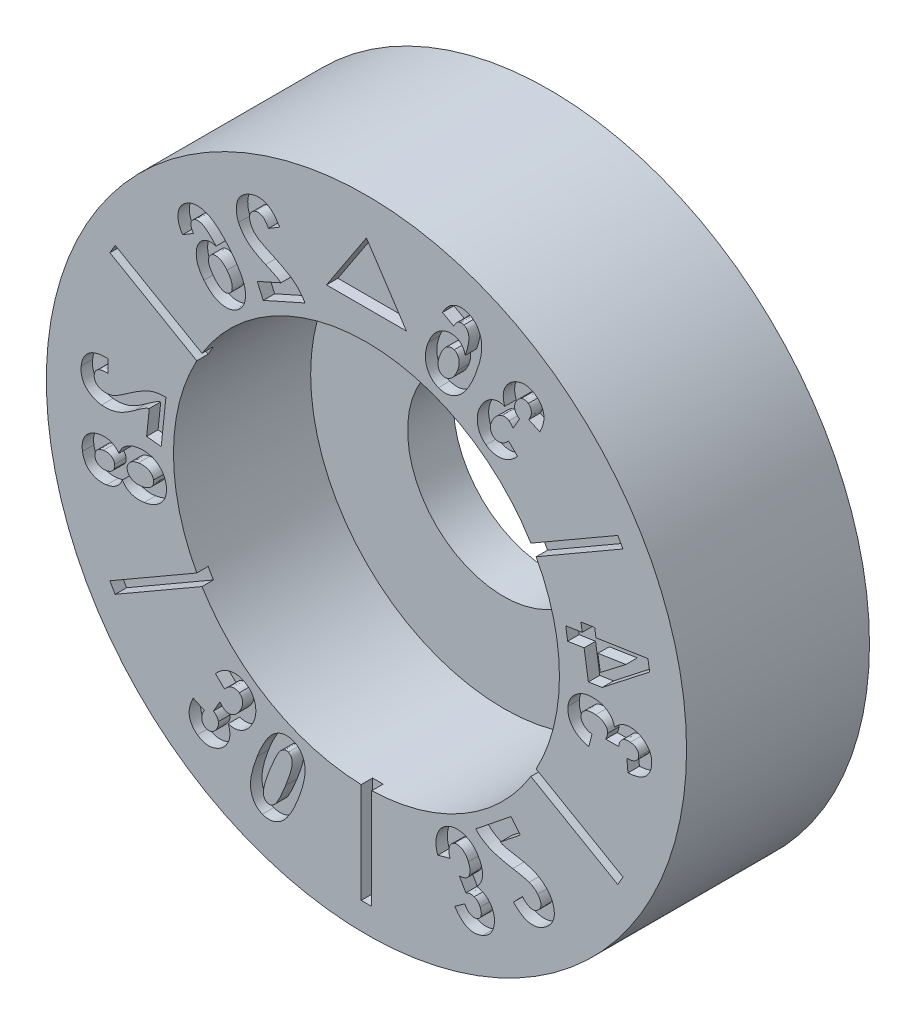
from build123d import *
from build123d.topology import SkipClean

# Parameters (mm, degrees)
SKETCH4_R           = 7
BOSS_EXTRUDE2_DEPTH = 4
SKETCH5_R           = 4.22
CUT_EXTRUDE2_DEPTH  = 3
SKETCH6_R           = 2.1
CUT_EXTRUDE3_DEPTH  = 11.344080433
SKETCH2_W           = 0.23
SKETCH2_H           = 3.311361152
CUT_EXTRUDE1_DEPTH  = 0.25
CUT_EXTRUDE4_DEPTH  = 0.25


with BuildPart() as part:
    # Sketch4 → Boss-Extrude2 (new body)
    with BuildSketch(Plane.XY):
        Circle(SKETCH4_R)
    extrude(amount=-BOSS_EXTRUDE2_DEPTH)

    # Sketch5 → Cut-Extrude2 (cut)
    with BuildSketch(Plane.XY):
        Circle(SKETCH5_R)
    extrude(amount=-CUT_EXTRUDE2_DEPTH, mode=Mode.SUBTRACT)

    # Sketch6 → Cut-Extrude3 (cut, through all)
    with BuildSketch(Plane.XY.offset(-3)):
        Circle(SKETCH6_R)
    extrude(amount=-CUT_EXTRUDE3_DEPTH, mode=Mode.SUBTRACT)

    # Sketch2 → Cut-Extrude1 (cut)
    # profile 1 of 17: a face of its own
    with BuildSketch(Plane.XY):
        with Locations((0, -4.755680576)):
            Rectangle(SKETCH2_W, SKETCH2_H)
    # profile 2 of 17: a face of its own
    with BuildSketch(Plane.XY):
        Polygon((-2.627178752, -1.649592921), (-5.494901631, -3.305273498), (-5.609901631, -3.106087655), (-2.742178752, -1.450407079), align=None)
    # profile 3 of 17: a face of its own
    with BuildSketch(Plane.XY):
        Polygon((-2.742178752, 1.450407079), (-5.609901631, 3.106087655), (-5.494901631, 3.305273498), (-2.627178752, 1.649592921), align=None)
    # profile 4 of 17: a face of its own
    with BuildSketch(Plane.XY):
        Polygon((2.627178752, 1.649592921), (5.494901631, 3.305273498), (5.609901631, 3.106087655), (2.742178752, 1.450407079), align=None)
    # profile 5 of 17: a face of its own
    with BuildSketch(Plane.XY):
        Polygon((2.742178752, -1.450407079), (5.609901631, -3.106087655), (5.494901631, -3.305273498), (2.627178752, -1.649592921), align=None)
    # profile 6 of 17: a face of its own
    with BuildSketch(Plane.XY):
        with BuildLine():
            Line((-2.38861569, 4.17471907), (-2.256937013, 3.880199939))
            Line((-2.256937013, 3.880199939), (-1.344315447, 4.287917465))
            add(Edge.make_bspline(
                [(-1.344315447, 4.287917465), (-1.35986274, 4.314109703), (-1.390802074, 4.366232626), (-1.446032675, 4.438548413), (-1.507471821, 4.505505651), (-1.56439157, 4.557424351), (-1.615671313, 4.596737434), (-1.659918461, 4.62755868), (-1.710098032, 4.659193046), (-1.766149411, 4.691687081), (-1.827747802, 4.72533601), (-1.894948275, 4.76007545), (-1.967894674, 4.795711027), (-2.01885546, 4.81896875), (-2.04516792, 4.830977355)],
                knots=[0, 0, 0, 0, 1.212157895, 2.412211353, 3.615463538, 4.827631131, 5.474319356, 6.187579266, 6.974328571, 7.83585823, 8.767313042, 9.769280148, 10.848217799, 12, 12, 12, 12], degree=3))
            add(Edge.make_bspline(
                [(-2.04516792, 4.830977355), (-2.065786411, 4.840432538), (-2.105104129, 4.858462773), (-2.160994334, 4.884926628), (-2.210718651, 4.909683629), (-2.254829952, 4.931944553), (-2.293133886, 4.951896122), (-2.325368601, 4.970213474), (-2.352059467, 4.985768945), (-2.367241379, 4.996391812), (-2.373987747, 5.001112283)],
                knots=[0, 0, 0, 0, 1.468908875, 2.801085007, 4.004342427, 5.065824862, 6.00092713, 6.800532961, 7.466994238, 8, 8, 8, 8], degree=3))
            add(Edge.make_bspline(
                [(-2.373987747, 5.001112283), (-2.39046362, 5.013728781), (-2.422557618, 5.038304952), (-2.463922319, 5.081058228), (-2.498091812, 5.127056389), (-2.514998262, 5.160477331), (-2.523354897, 5.176996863)],
                knots=[0, 0, 0, 0, 1.066040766, 2.076582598, 3.049280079, 4, 4, 4, 4], degree=3))
            add(Edge.make_bspline(
                [(-2.523354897, 5.176996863), (-2.53042099, 5.194315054), (-2.543724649, 5.226920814), (-2.554704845, 5.275855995), (-2.556861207, 5.321021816), (-2.549489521, 5.362172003), (-2.533755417, 5.398542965), (-2.511083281, 5.430121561), (-2.481085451, 5.456294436), (-2.457200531, 5.468499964), (-2.444926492, 5.474772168)],
                knots=[0, 0, 0, 0, 1.28881253, 2.426507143, 3.442433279, 4.389029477, 5.284282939, 6.154472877, 7.051616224, 8, 8, 8, 8], degree=3))
            add(Edge.make_bspline(
                [(-2.444926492, 5.474772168), (-2.430888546, 5.480206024), (-2.4039467, 5.490634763), (-2.36133182, 5.49451389), (-2.320449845, 5.487560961), (-2.281053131, 5.470100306), (-2.243464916, 5.442163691), (-2.207827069, 5.403767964), (-2.173238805, 5.35576536), (-2.153484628, 5.318913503), (-2.14297927, 5.299315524)],
                knots=[0, 0, 0, 0, 0.919529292, 1.764774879, 2.587023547, 3.436938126, 4.382614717, 5.43848238, 6.637773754, 8, 8, 8, 8], degree=3))
            Line((-2.14297927, 5.299315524), (-1.898187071, 5.44668996))
            add(Edge.make_bspline(
                [(-1.898187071, 5.44668996), (-1.909601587, 5.46612119), (-1.93168282, 5.503710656), (-1.967527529, 5.556172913), (-2.004293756, 5.603067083), (-2.042093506, 5.644674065), (-2.081029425, 5.680695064), (-2.120866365, 5.711533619), (-2.162272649, 5.736016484), (-2.204221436, 5.755945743), (-2.247600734, 5.769600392), (-2.291370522, 5.77984777), (-2.336113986, 5.784331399), (-2.381503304, 5.783803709), (-2.42762579, 5.779127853), (-2.474533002, 5.769124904), (-2.522108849, 5.754429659), (-2.55338014, 5.741404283), (-2.569320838, 5.734764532)],
                knots=[0, 0, 0, 0, 1.321570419, 2.556560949, 3.723607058, 4.814393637, 5.85001508, 6.831554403, 7.762943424, 8.66656666, 9.549030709, 10.425114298, 11.299333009, 12.178931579, 13.08399292, 14.013874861, 14.987562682, 16, 16, 16, 16], degree=3))
            add(Edge.make_bspline(
                [(-2.569320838, 5.734764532), (-2.586383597, 5.726700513), (-2.619624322, 5.710990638), (-2.665159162, 5.682317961), (-2.706176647, 5.651694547), (-2.741248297, 5.617236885), (-2.771828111, 5.580503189), (-2.796267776, 5.540197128), (-2.816078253, 5.497499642), (-2.829873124, 5.452131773), (-2.839235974, 5.405723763), (-2.845218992, 5.359168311), (-2.846917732, 5.312843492), (-2.84426771, 5.266789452), (-2.838344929, 5.220880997), (-2.82801476, 5.17523172), (-2.813663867, 5.129839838), (-2.801392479, 5.100274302), (-2.795190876, 5.08533274)],
                knots=[0, 0, 0, 0, 1.169979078, 2.279288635, 3.332734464, 4.339786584, 5.322922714, 6.290523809, 7.255851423, 8.23619719, 9.224803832, 10.190899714, 11.145586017, 12.096438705, 13.050227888, 14.014490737, 14.99658141, 16, 16, 16, 16], degree=3))
            add(Edge.make_bspline(
                [(-2.795190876, 5.08533274), (-2.787406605, 5.068645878), (-2.771935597, 5.035481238), (-2.744158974, 4.988199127), (-2.713687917, 4.942947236), (-2.67958726, 4.900102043), (-2.64213389, 4.859249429), (-2.60152951, 4.819568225), (-2.55658033, 4.781977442), (-2.516213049, 4.751839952), (-2.480971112, 4.727857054), (-2.450884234, 4.709493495), (-2.418041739, 4.689987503), (-2.381629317, 4.670554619), (-2.342510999, 4.64982221), (-2.29982828, 4.6288767), (-2.254040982, 4.607379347), (-2.222355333, 4.593044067), (-2.206076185, 4.585679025)],
                knots=[0, 0, 0, 0, 1.114912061, 2.215854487, 3.317809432, 4.417614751, 5.529497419, 6.673597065, 7.854295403, 9.076315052, 9.724081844, 10.43590995, 11.211242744, 12.037756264, 12.935783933, 13.893213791, 14.917595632, 16, 16, 16, 16], degree=3))
            add(Edge.make_bspline(
                [(-2.206076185, 4.585679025), (-2.191041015, 4.578929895), (-2.16240862, 4.566077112), (-2.121703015, 4.547207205), (-2.085332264, 4.530059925), (-2.052847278, 4.514951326), (-2.024791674, 4.501278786), (-2.00065839, 4.489568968), (-1.98077449, 4.479719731), (-1.951924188, 4.463789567), (-1.914804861, 4.440739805), (-1.885394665, 4.417103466), (-1.87130059, 4.405776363)],
                knots=[0, 0, 0, 0, 1.296655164, 2.469299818, 3.529977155, 4.460362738, 5.288024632, 5.985415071, 6.571013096, 7.033411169, 8.57833912, 10, 10, 10, 10], degree=3))
            Line((-1.87130059, 4.405776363), (-2.38861569, 4.17471907))
        make_face()
    # profile 7 of 17: a face of its own
    with BuildSketch(Plane.XY):
        with BuildLine():
            Line((-4.021446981, 4.241792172), (-3.784163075, 4.385134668))
            add(Edge.make_bspline(
                [(-3.784163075, 4.385134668), (-3.792506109, 4.398721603), (-3.808267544, 4.424389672), (-3.826394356, 4.463097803), (-3.837047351, 4.499547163), (-3.841614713, 4.533552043), (-3.838100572, 4.565513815), (-3.827377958, 4.594734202), (-3.80996458, 4.621719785), (-3.793719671, 4.635990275), (-3.785236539, 4.643442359)],
                knots=[0, 0, 0, 0, 1.329232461, 2.511149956, 3.551666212, 4.486102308, 5.354009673, 6.204153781, 7.062204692, 8, 8, 8, 8], degree=3))
            add(Edge.make_bspline(
                [(-3.785236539, 4.643442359), (-3.779194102, 4.647904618), (-3.767142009, 4.656804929), (-3.746828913, 4.666321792), (-3.725679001, 4.673573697), (-3.70312931, 4.677313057), (-3.67948127, 4.677489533), (-3.654572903, 4.675013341), (-3.628567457, 4.66959434), (-3.600961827, 4.660908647), (-3.571411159, 4.647347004), (-3.539433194, 4.628022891), (-3.504517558, 4.602937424), (-3.466918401, 4.571835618), (-3.425745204, 4.535607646), (-3.382365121, 4.492808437), (-3.335400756, 4.444708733), (-3.303982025, 4.409910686), (-3.287523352, 4.391681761)],
                knots=[0, 0, 0, 0, 0.590073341, 1.176945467, 1.75728303, 2.346499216, 2.967308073, 3.614141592, 4.313995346, 5.055171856, 5.888063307, 6.867211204, 7.992511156, 9.270059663, 10.707660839, 12.309091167, 14.066520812, 16, 16, 16, 16], degree=3))
            add(Edge.make_bspline(
                [(-3.287523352, 4.391681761), (-3.301999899, 4.395585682), (-3.330048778, 4.403149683), (-3.372171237, 4.408841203), (-3.412370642, 4.410385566), (-3.450943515, 4.40727229), (-3.487862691, 4.399227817), (-3.52300819, 4.386103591), (-3.556879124, 4.368945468), (-3.577188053, 4.353657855), (-3.587465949, 4.345921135)],
                knots=[0, 0, 0, 0, 1.136755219, 2.20250798, 3.217303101, 4.184595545, 5.131238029, 6.074402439, 7.025498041, 8, 8, 8, 8], degree=3))
            add(Edge.make_bspline(
                [(-3.587465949, 4.345921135), (-3.598286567, 4.336666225), (-3.619758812, 4.318300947), (-3.647483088, 4.286271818), (-3.670536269, 4.250879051), (-3.690003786, 4.212822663), (-3.704522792, 4.171401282), (-3.715123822, 4.127081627), (-3.720653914, 4.079637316), (-3.722897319, 4.02973872), (-3.720108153, 3.978217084), (-3.712046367, 3.926074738), (-3.698537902, 3.874062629), (-3.680519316, 3.821704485), (-3.656069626, 3.76981896), (-3.626921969, 3.717590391), (-3.593020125, 3.665062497), (-3.566786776, 3.631476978), (-3.553384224, 3.614318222)],
                knots=[0, 0, 0, 0, 0.839535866, 1.6659602, 2.4893798, 3.327715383, 4.182490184, 5.073673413, 6.011828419, 6.997152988, 8.018807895, 9.051697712, 10.105792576, 11.186686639, 12.314915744, 13.48577513, 14.715488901, 16, 16, 16, 16], degree=3))
            add(Edge.make_bspline(
                [(-3.553384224, 3.614318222), (-3.538570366, 3.596444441), (-3.509723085, 3.561638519), (-3.463438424, 3.514396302), (-3.416453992, 3.47271377), (-3.368341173, 3.436979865), (-3.319502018, 3.406418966), (-3.269498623, 3.38189747), (-3.218485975, 3.363107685), (-3.167013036, 3.349840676), (-3.115793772, 3.342300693), (-3.065860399, 3.34001273), (-3.017539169, 3.342167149), (-2.970865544, 3.350526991), (-2.925726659, 3.363865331), (-2.882171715, 3.382609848), (-2.839939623, 3.406179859), (-2.814031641, 3.425871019), (-2.80090447, 3.435848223)],
                knots=[0, 0, 0, 0, 1.286012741, 2.504274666, 3.660948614, 4.763230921, 5.821647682, 6.849338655, 7.843618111, 8.829275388, 9.789739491, 10.707075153, 11.595904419, 12.464214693, 13.3279517, 14.198565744, 15.087241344, 16, 16, 16, 16], degree=3))
            add(Edge.make_bspline(
                [(-2.80090447, 3.435848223), (-2.787171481, 3.447632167), (-2.760029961, 3.470921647), (-2.725579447, 3.511647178), (-2.697449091, 3.556110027), (-2.674622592, 3.603803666), (-2.658761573, 3.655539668), (-2.647947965, 3.710649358), (-2.644052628, 3.769544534), (-2.645589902, 3.832055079), (-2.654593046, 3.898584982), (-2.673498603, 3.968667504), (-2.700968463, 4.042549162), (-2.737464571, 4.12030052), (-2.782756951, 4.201943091), (-2.837459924, 4.2872061), (-2.900317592, 4.376744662), (-2.947074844, 4.436282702), (-2.971313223, 4.467146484)],
                knots=[0, 0, 0, 0, 0.743911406, 1.470247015, 2.185240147, 2.904906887, 3.639442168, 4.406423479, 5.211503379, 6.063502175, 6.976730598, 7.967334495, 9.044657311, 10.217329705, 11.499119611, 12.884624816, 14.38502814, 16, 16, 16, 16], degree=3))
            add(Edge.make_bspline(
                [(-2.971313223, 4.467146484), (-2.996577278, 4.497962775), (-3.045338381, 4.557440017), (-3.120673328, 4.63946097), (-3.193686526, 4.71236771), (-3.265318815, 4.775130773), (-3.334939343, 4.828360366), (-3.403026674, 4.871771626), (-3.469470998, 4.905590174), (-3.534466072, 4.929324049), (-3.597300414, 4.94467424), (-3.657948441, 4.952917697), (-3.716526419, 4.954181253), (-3.773047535, 4.948903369), (-3.827344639, 4.935690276), (-3.879412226, 4.916057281), (-3.929427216, 4.889250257), (-3.959902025, 4.866412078), (-3.975438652, 4.854768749)],
                knots=[0, 0, 0, 0, 1.58852041, 3.06593725, 4.438302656, 5.700533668, 6.860412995, 7.929199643, 8.915840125, 9.826880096, 10.681477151, 11.490170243, 12.262265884, 13.01294377, 13.746779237, 14.48327522, 15.226745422, 16, 16, 16, 16], degree=3))
            add(Edge.make_bspline(
                [(-3.975438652, 4.854768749), (-3.985662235, 4.846067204), (-4.005749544, 4.828970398), (-4.032693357, 4.800585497), (-4.056144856, 4.770533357), (-4.076493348, 4.738904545), (-4.092738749, 4.705289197), (-4.105813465, 4.670094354), (-4.115350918, 4.633232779), (-4.121603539, 4.594773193), (-4.124060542, 4.554802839), (-4.122167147, 4.513436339), (-4.116117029, 4.470914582), (-4.105763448, 4.427170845), (-4.09062631, 4.382482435), (-4.071981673, 4.33620848), (-4.048708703, 4.288986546), (-4.030678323, 4.257773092), (-4.021446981, 4.241792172)],
                knots=[0, 0, 0, 0, 0.948182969, 1.862991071, 2.759615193, 3.638731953, 4.515150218, 5.392412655, 6.287838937, 7.201270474, 8.14188996, 9.112295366, 10.122282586, 11.172791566, 12.283843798, 13.453193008, 14.6960648, 16, 16, 16, 16], degree=3))
        make_face()
        with BuildLine():
            add(Edge.make_bspline(
                [(-3.049588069, 4.05576592), (-3.04100446, 4.044918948), (-3.024294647, 4.02380302), (-3.002490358, 3.991248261), (-2.983412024, 3.959646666), (-2.96726972, 3.928868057), (-2.95434606, 3.898669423), (-2.944688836, 3.869246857), (-2.938101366, 3.840515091), (-2.934410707, 3.812666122), (-2.934290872, 3.786053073), (-2.935168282, 3.761183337), (-2.939372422, 3.738265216), (-2.944754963, 3.716924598), (-2.953462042, 3.69769655), (-2.963468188, 3.679833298), (-2.976414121, 3.664258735), (-2.986409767, 3.655394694), (-2.991390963, 3.650977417)],
                knots=[0, 0, 0, 0, 1.47186025, 2.865287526, 4.167107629, 5.400012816, 6.561579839, 7.659591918, 8.691521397, 9.695817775, 10.641987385, 11.521933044, 12.339338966, 13.117911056, 13.857540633, 14.578890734, 15.291809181, 16, 16, 16, 16], degree=3))
            add(Edge.make_bspline(
                [(-2.991390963, 3.650977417), (-3.001881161, 3.6437868), (-3.022671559, 3.629535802), (-3.059775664, 3.618545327), (-3.099696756, 3.617851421), (-3.134398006, 3.624582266), (-3.163129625, 3.635408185), (-3.186202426, 3.646897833), (-3.209686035, 3.66199353), (-3.233922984, 3.680045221), (-3.258410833, 3.701902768), (-3.283870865, 3.726812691), (-3.30965769, 3.75539982), (-3.326481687, 3.775938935), (-3.335170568, 3.786546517)],
                knots=[0, 0, 0, 0, 1.106023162, 2.192014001, 3.322127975, 4.567215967, 5.254765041, 6.000431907, 6.814799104, 7.690827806, 8.638351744, 9.680306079, 10.801976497, 12, 12, 12, 12], degree=3))
            add(Edge.make_bspline(
                [(-3.335170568, 3.786546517), (-3.344033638, 3.79772621), (-3.361141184, 3.819305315), (-3.383907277, 3.852146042), (-3.403460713, 3.883735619), (-3.420266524, 3.913886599), (-3.433346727, 3.942945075), (-3.443154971, 3.97073919), (-3.449829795, 3.997346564), (-3.45314791, 4.02285079), (-3.453994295, 4.046964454), (-3.451882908, 4.069495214), (-3.448195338, 4.090610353), (-3.441980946, 4.110377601), (-3.433363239, 4.128649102), (-3.423008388, 4.145803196), (-3.409669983, 4.160908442), (-3.399590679, 4.169848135), (-3.394485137, 4.174376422)],
                knots=[0, 0, 0, 0, 1.567222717, 3.025061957, 4.387334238, 5.648299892, 6.814829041, 7.884024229, 8.883135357, 9.822612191, 10.705120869, 11.528135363, 12.304490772, 13.056610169, 13.796616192, 14.520114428, 15.250383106, 16, 16, 16, 16], degree=3))
            add(Edge.make_bspline(
                [(-3.394485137, 4.174376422), (-3.38357242, 4.181874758), (-3.36200207, 4.196696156), (-3.323219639, 4.208170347), (-3.28133868, 4.209478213), (-3.244705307, 4.203113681), (-3.214563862, 4.193187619), (-3.191213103, 4.182177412), (-3.167758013, 4.16849843), (-3.144471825, 4.151383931), (-3.120611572, 4.132037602), (-3.096808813, 4.109418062), (-3.072800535, 4.083932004), (-3.057488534, 4.065352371), (-3.049588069, 4.05576592)],
                knots=[0, 0, 0, 0, 1.168433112, 2.309554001, 3.527482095, 4.857217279, 5.584622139, 6.336539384, 7.14242156, 7.988878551, 8.896747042, 9.865263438, 10.898549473, 12, 12, 12, 12], degree=3))
        make_face(mode=Mode.SUBTRACT)
    # profile 8 of 17: a face of its own
    with BuildSketch(Plane.XY):
        with BuildLine():
            Line((-4.806768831, 0.028828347), (-4.487853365, -0.004358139))
            Line((-4.487853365, -0.004358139), (-4.384871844, 0.982652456))
            add(Edge.make_bspline(
                [(-4.384871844, 0.982652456), (-4.415096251, 0.982269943), (-4.475329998, 0.981507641), (-4.565005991, 0.970263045), (-4.653197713, 0.950528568), (-4.726183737, 0.927401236), (-4.785405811, 0.902403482), (-4.83404411, 0.879929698), (-4.885881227, 0.852224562), (-4.941767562, 0.820644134), (-5.001024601, 0.784257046), (-5.064342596, 0.74388267), (-5.13083082, 0.69845152), (-5.17630209, 0.666543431), (-5.199782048, 0.650067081)],
                knots=[0, 0, 0, 0, 1.211869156, 2.415114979, 3.617279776, 4.833766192, 5.480004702, 6.195062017, 6.982399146, 7.837034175, 8.769941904, 9.771538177, 10.849291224, 12, 12, 12, 12], degree=3))
            add(Edge.make_bspline(
                [(-5.199782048, 0.650067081), (-5.218189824, 0.637002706), (-5.25331231, 0.612075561), (-5.303939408, 0.577161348), (-5.35007064, 0.546858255), (-5.390891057, 0.51961191), (-5.427279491, 0.496897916), (-5.459002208, 0.478074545), (-5.485774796, 0.463072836), (-5.50246253, 0.455233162), (-5.509848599, 0.451763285)],
                knots=[0, 0, 0, 0, 1.470364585, 2.805491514, 4.0056549, 5.065580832, 6.002267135, 6.799313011, 7.468570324, 8, 8, 8, 8], degree=3))
            add(Edge.make_bspline(
                [(-5.509848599, 0.451763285), (-5.528789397, 0.443858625), (-5.565642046, 0.428478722), (-5.622810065, 0.41424676), (-5.679342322, 0.407738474), (-5.716602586, 0.409896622), (-5.735037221, 0.410964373)],
                knots=[0, 0, 0, 0, 1.062812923, 2.067889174, 3.044082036, 4, 4, 4, 4], degree=3))
            add(Edge.make_bspline(
                [(-5.735037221, 0.410964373), (-5.753424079, 0.413422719), (-5.787958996, 0.418040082), (-5.835627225, 0.432806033), (-5.875472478, 0.453662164), (-5.907303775, 0.480556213), (-5.931110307, 0.512006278), (-5.946401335, 0.547482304), (-5.954073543, 0.586182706), (-5.952632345, 0.61270944), (-5.951888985, 0.626391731)],
                knots=[0, 0, 0, 0, 1.286685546, 2.416703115, 3.446991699, 4.38911374, 5.28800676, 6.160909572, 7.051410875, 8, 8, 8, 8], degree=3))
            add(Edge.make_bspline(
                [(-5.951888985, 0.626391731), (-5.949655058, 0.641143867), (-5.94537349, 0.669417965), (-5.927387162, 0.707731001), (-5.901458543, 0.739750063), (-5.86664567, 0.76462232), (-5.823984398, 0.783100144), (-5.773339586, 0.79475191), (-5.714765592, 0.800764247), (-5.673191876, 0.799385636), (-5.651071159, 0.798652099)],
                knots=[0, 0, 0, 0, 0.917495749, 1.758481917, 2.579149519, 3.436617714, 4.373781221, 5.43330302, 6.634301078, 8, 8, 8, 8], degree=3))
            Line((-5.651071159, 0.798652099), (-5.65647275, 1.08168275))
            add(Edge.make_bspline(
                [(-5.65647275, 1.08168275), (-5.678837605, 1.08159366), (-5.722130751, 1.081421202), (-5.784952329, 1.076600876), (-5.843565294, 1.068818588), (-5.8979602, 1.05654583), (-5.948341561, 1.041339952), (-5.994628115, 1.02223826), (-6.036618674, 0.999418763), (-6.074300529, 0.972661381), (-6.108015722, 0.942709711), (-6.137861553, 0.909685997), (-6.163973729, 0.873646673), (-6.18646179, 0.834633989), (-6.205093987, 0.792391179), (-6.219792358, 0.747234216), (-6.230743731, 0.699063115), (-6.235048, 0.665807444), (-6.237256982, 0.648740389)],
                knots=[0, 0, 0, 0, 1.321555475, 2.558223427, 3.721519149, 4.813249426, 5.850562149, 6.828694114, 7.767736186, 8.669154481, 9.554368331, 10.428276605, 11.294894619, 12.180196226, 13.084940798, 14.018756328, 14.983211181, 16, 16, 16, 16], degree=3))
            add(Edge.make_bspline(
                [(-6.237256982, 0.648740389), (-6.238865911, 0.630094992), (-6.242006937, 0.593694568), (-6.239993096, 0.540310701), (-6.233534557, 0.489837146), (-6.22206181, 0.442381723), (-6.204968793, 0.398176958), (-6.183329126, 0.356795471), (-6.155945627, 0.318903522), (-6.124055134, 0.284192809), (-6.088570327, 0.253293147), (-6.051461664, 0.225028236), (-6.012545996, 0.200247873), (-5.971638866, 0.179202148), (-5.928883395, 0.162028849), (-5.88450852, 0.148189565), (-5.838560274, 0.137442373), (-5.807080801, 0.13358379), (-5.791202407, 0.131637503)],
                knots=[0, 0, 0, 0, 1.16814542, 2.280508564, 3.329352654, 4.343081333, 5.32197149, 6.283149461, 7.252179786, 8.233607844, 9.221352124, 10.187662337, 11.145524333, 12.099452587, 13.057314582, 14.019996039, 15.001276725, 16, 16, 16, 16], degree=3))
            add(Edge.make_bspline(
                [(-5.791202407, 0.131637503), (-5.772938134, 0.130104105), (-5.736676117, 0.127059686), (-5.682242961, 0.12739451), (-5.628373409, 0.131168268), (-5.574753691, 0.13917772), (-5.521012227, 0.15058813), (-5.466764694, 0.166048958), (-5.412191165, 0.186069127), (-5.366190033, 0.205817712), (-5.328228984, 0.224583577), (-5.297148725, 0.24055172), (-5.264378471, 0.259731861), (-5.229240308, 0.280874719), (-5.192221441, 0.304982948), (-5.152638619, 0.330677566), (-5.1115858, 0.35960485), (-5.083459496, 0.37951015), (-5.068972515, 0.389762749)],
                knots=[0, 0, 0, 0, 1.11796755, 2.219620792, 3.317735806, 4.410812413, 5.52502108, 6.668327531, 7.849651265, 9.070047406, 9.7210273, 10.433543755, 11.201719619, 12.037454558, 12.935835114, 13.897257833, 14.916943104, 16, 16, 16, 16], degree=3))
            add(Edge.make_bspline(
                [(-5.068972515, 0.389762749), (-5.055643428, 0.399269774), (-5.030178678, 0.417432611), (-4.993798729, 0.443138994), (-4.961322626, 0.466449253), (-4.931834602, 0.486195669), (-4.906345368, 0.503994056), (-4.884187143, 0.518566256), (-4.865867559, 0.530675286), (-4.838055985, 0.547576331), (-4.799841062, 0.567906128), (-4.765084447, 0.581557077), (-4.748446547, 0.588091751)],
                knots=[0, 0, 0, 0, 1.298948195, 2.481594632, 3.534292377, 4.470297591, 5.297044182, 6.000620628, 6.574384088, 7.039060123, 8.582605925, 10, 10, 10, 10], degree=3))
            Line((-4.748446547, 0.588091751), (-4.806768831, 0.028828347))
        make_face()
    # profile 9 of 17: a face of its own
    with BuildSketch(Plane.XY):
        with BuildLine():
            add(Edge.make_bspline(
                [(-5.413754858, -0.595152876), (-5.425691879, -0.58005877), (-5.448978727, -0.550613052), (-5.490137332, -0.513115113), (-5.535169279, -0.482852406), (-5.584334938, -0.460308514), (-5.637006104, -0.444152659), (-5.693661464, -0.436889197), (-5.753898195, -0.435546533), (-5.794811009, -0.440681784), (-5.815948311, -0.443334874)],
                knots=[0, 0, 0, 0, 1.015015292, 1.980100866, 2.927107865, 3.869211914, 4.826986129, 5.825014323, 6.87630976, 8, 8, 8, 8], degree=3))
            add(Edge.make_bspline(
                [(-5.815948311, -0.443334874), (-5.833120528, -0.446281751), (-5.866633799, -0.452032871), (-5.914663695, -0.46558245), (-5.959647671, -0.481878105), (-6.001143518, -0.501956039), (-6.039445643, -0.52526556), (-6.074517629, -0.551827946), (-6.106714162, -0.581409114), (-6.134836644, -0.6146346), (-6.159247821, -0.650346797), (-6.179522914, -0.688408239), (-6.19571894, -0.728347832), (-6.207040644, -0.770411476), (-6.214250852, -0.814306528), (-6.217317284, -0.86028557), (-6.216000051, -0.908244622), (-6.211664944, -0.940546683), (-6.209453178, -0.95702715)],
                knots=[0, 0, 0, 0, 1.143384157, 2.2314267, 3.271871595, 4.281543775, 5.253015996, 6.211372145, 7.166253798, 8.117950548, 9.06317768, 10.001686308, 10.944475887, 11.886960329, 12.855929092, 13.861032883, 14.908701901, 16, 16, 16, 16], degree=3))
            add(Edge.make_bspline(
                [(-6.209453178, -0.95702715), (-6.206299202, -0.974391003), (-6.200183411, -1.008060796), (-6.18647592, -1.056314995), (-6.169053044, -1.100740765), (-6.147861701, -1.14136494), (-6.122666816, -1.177993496), (-6.09392168, -1.21070059), (-6.061437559, -1.239635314), (-6.025566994, -1.264465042), (-5.987289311, -1.285399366), (-5.947379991, -1.302497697), (-5.906257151, -1.316056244), (-5.863766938, -1.325453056), (-5.820111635, -1.331295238), (-5.775237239, -1.333716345), (-5.72899455, -1.331565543), (-5.697976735, -1.327574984), (-5.682224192, -1.32554836)],
                knots=[0, 0, 0, 0, 1.166571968, 2.262069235, 3.311288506, 4.317357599, 5.285230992, 6.244188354, 7.190076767, 8.154729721, 9.122871, 10.070437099, 11.02233772, 11.982105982, 12.943763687, 13.93231424, 14.949916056, 16, 16, 16, 16], degree=3))
            add(Edge.make_bspline(
                [(-5.682224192, -1.32554836), (-5.661236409, -1.32177232), (-5.620328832, -1.31441239), (-5.562687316, -1.294685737), (-5.510132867, -1.269540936), (-5.463698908, -1.237720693), (-5.423028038, -1.201042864), (-5.388368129, -1.160028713), (-5.360460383, -1.114589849), (-5.347475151, -1.081709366), (-5.34096562, -1.065226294)],
                knots=[0, 0, 0, 0, 1.131187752, 2.204813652, 3.224503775, 4.216758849, 5.183289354, 6.125124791, 7.060120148, 8, 8, 8, 8], degree=3))
            add(Edge.make_bspline(
                [(-5.34096562, -1.065226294), (-5.327234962, -1.083633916), (-5.300417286, -1.11958628), (-5.2521325, -1.16500305), (-5.199084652, -1.201656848), (-5.14064125, -1.228660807), (-5.077250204, -1.247486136), (-5.008720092, -1.256388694), (-4.935132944, -1.257347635), (-4.885071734, -1.250755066), (-4.859048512, -1.247328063)],
                knots=[0, 0, 0, 0, 1.00645162, 1.965724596, 2.894746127, 3.825150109, 4.779737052, 5.786131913, 6.84916922, 8, 8, 8, 8], degree=3))
            add(Edge.make_bspline(
                [(-4.859048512, -1.247328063), (-4.832258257, -1.242552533), (-4.779912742, -1.233221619), (-4.705558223, -1.209331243), (-4.637084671, -1.179051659), (-4.575276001, -1.141839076), (-4.520590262, -1.098974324), (-4.473649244, -1.051056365), (-4.435558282, -0.997920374), (-4.406044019, -0.940480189), (-4.385471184, -0.879687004), (-4.373207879, -0.816516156), (-4.370204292, -0.751110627), (-4.375503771, -0.707420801), (-4.378193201, -0.68524867)],
                knots=[0, 0, 0, 0, 1.179157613, 2.303957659, 3.37756182, 4.420159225, 5.424515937, 6.383753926, 7.319505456, 8.249292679, 9.17450986, 10.093694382, 11.032569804, 12, 12, 12, 12], degree=3))
            add(Edge.make_bspline(
                [(-4.378193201, -0.68524867), (-4.381238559, -0.667980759), (-4.387226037, -0.634030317), (-4.402250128, -0.585242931), (-4.420782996, -0.539233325), (-4.444053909, -0.496357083), (-4.471666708, -0.456732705), (-4.503357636, -0.419954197), (-4.539545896, -0.386531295), (-4.57926559, -0.355937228), (-4.622572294, -0.329437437), (-4.668737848, -0.307440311), (-4.717502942, -0.290818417), (-4.768643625, -0.278653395), (-4.822306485, -0.271760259), (-4.878567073, -0.269138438), (-4.937303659, -0.271709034), (-4.976992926, -0.276906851), (-4.997289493, -0.279564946)],
                knots=[0, 0, 0, 0, 1.010644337, 1.987027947, 2.938358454, 3.868158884, 4.794557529, 5.719570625, 6.66306469, 7.631458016, 8.607361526, 9.586368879, 10.575302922, 11.57386741, 12.613860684, 13.691590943, 14.819510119, 16, 16, 16, 16], degree=3))
            add(Edge.make_bspline(
                [(-4.997289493, -0.279564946), (-5.023077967, -0.284285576), (-5.073202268, -0.293460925), (-5.143963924, -0.316776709), (-5.208101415, -0.346922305), (-5.265158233, -0.384048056), (-5.314754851, -0.42797905), (-5.356406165, -0.477837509), (-5.390546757, -0.533626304), (-5.405933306, -0.574417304), (-5.413754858, -0.595152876)],
                knots=[0, 0, 0, 0, 1.140206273, 2.216185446, 3.232595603, 4.217636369, 5.16908033, 6.105660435, 7.037037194, 8, 8, 8, 8], degree=3))
        make_face()
        with BuildLine():
            add(Edge.make_bspline(
                [(-5.75027318, -0.706064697), (-5.733685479, -0.703964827), (-5.702200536, -0.699979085), (-5.656764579, -0.702539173), (-5.616338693, -0.712075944), (-5.581346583, -0.72889447), (-5.552473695, -0.751881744), (-5.529582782, -0.77927055), (-5.513218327, -0.811383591), (-5.508420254, -0.834896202), (-5.505948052, -0.847011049)],
                knots=[0, 0, 0, 0, 1.262558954, 2.396449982, 3.421453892, 4.385533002, 5.307572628, 6.191674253, 7.068262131, 8, 8, 8, 8], degree=3))
            add(Edge.make_bspline(
                [(-5.505948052, -0.847011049), (-5.504676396, -0.859412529), (-5.502184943, -0.88370976), (-5.507530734, -0.919796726), (-5.521276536, -0.953258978), (-5.541910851, -0.983981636), (-5.569884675, -1.011311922), (-5.605662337, -1.032637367), (-5.648273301, -1.048682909), (-5.679374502, -1.054649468), (-5.695842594, -1.057808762)],
                knots=[0, 0, 0, 0, 0.934505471, 1.830902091, 2.708602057, 3.633376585, 4.59522326, 5.622956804, 6.741355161, 8, 8, 8, 8], degree=3))
            add(Edge.make_bspline(
                [(-5.695842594, -1.057808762), (-5.711968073, -1.059711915), (-5.742617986, -1.063329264), (-5.78699341, -1.06097818), (-5.826836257, -1.051029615), (-5.861378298, -1.033952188), (-5.890457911, -1.011497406), (-5.912857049, -0.983997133), (-5.929033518, -0.952307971), (-5.934039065, -0.92910044), (-5.936592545, -0.917261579)],
                knots=[0, 0, 0, 0, 1.244135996, 2.364745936, 3.388520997, 4.37284503, 5.300352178, 6.18496009, 7.074093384, 8, 8, 8, 8], degree=3))
            add(Edge.make_bspline(
                [(-5.936592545, -0.917261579), (-5.937821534, -0.904591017), (-5.940204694, -0.880021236), (-5.934880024, -0.843492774), (-5.92095256, -0.809914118), (-5.900252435, -0.778888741), (-5.872218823, -0.75196909), (-5.837219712, -0.73065313), (-5.796145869, -0.714507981), (-5.766055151, -0.708969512), (-5.75027318, -0.706064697)],
                knots=[0, 0, 0, 0, 0.962574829, 1.866551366, 2.764666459, 3.697260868, 4.675504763, 5.685074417, 6.785868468, 8, 8, 8, 8], degree=3))
        make_face(mode=Mode.SUBTRACT)
        with BuildLine():
            add(Edge.make_bspline(
                [(-4.987119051, -0.561809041), (-4.975486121, -0.560114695), (-4.952802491, -0.556810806), (-4.919330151, -0.554841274), (-4.887561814, -0.554459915), (-4.857618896, -0.556923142), (-4.829515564, -0.561462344), (-4.803185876, -0.568118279), (-4.778377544, -0.576603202), (-4.74893319, -0.59142895), (-4.716464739, -0.612989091), (-4.685863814, -0.644990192), (-4.663934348, -0.681804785), (-4.657888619, -0.709011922), (-4.654832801, -0.72276379)],
                knots=[0, 0, 0, 0, 1.028814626, 2.006137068, 2.933337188, 3.80832557, 4.633104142, 5.422973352, 6.184121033, 6.92299525, 8.304891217, 9.573107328, 10.773325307, 12, 12, 12, 12], degree=3))
            add(Edge.make_bspline(
                [(-4.654832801, -0.72276379), (-4.653512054, -0.736662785), (-4.650899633, -0.76415484), (-4.660320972, -0.805115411), (-4.678592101, -0.844030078), (-4.702235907, -0.873217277), (-4.725182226, -0.895087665), (-4.745536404, -0.910383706), (-4.768534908, -0.924128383), (-4.794145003, -0.936408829), (-4.822403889, -0.947081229), (-4.85306341, -0.956970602), (-4.886557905, -0.964758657), (-4.909869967, -0.968657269), (-4.921861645, -0.970662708)],
                knots=[0, 0, 0, 0, 1.226729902, 2.426457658, 3.65977534, 4.999665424, 5.716662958, 6.458497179, 7.243987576, 8.080851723, 8.964739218, 9.91154292, 10.925701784, 12, 12, 12, 12], degree=3))
            add(Edge.make_bspline(
                [(-4.921861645, -0.970662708), (-4.942299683, -0.973156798), (-4.981193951, -0.977903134), (-5.037741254, -0.97534327), (-5.088831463, -0.964333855), (-5.133718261, -0.944626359), (-5.171406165, -0.918358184), (-5.201049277, -0.88654444), (-5.221954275, -0.849369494), (-5.227895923, -0.821964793), (-5.230904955, -0.808086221)],
                knots=[0, 0, 0, 0, 1.266821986, 2.410804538, 3.469649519, 4.468864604, 5.4110398, 6.280213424, 7.129047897, 8, 8, 8, 8], degree=3))
            add(Edge.make_bspline(
                [(-5.230904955, -0.808086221), (-5.23219237, -0.794197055), (-5.234748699, -0.766618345), (-5.225727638, -0.725326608), (-5.206630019, -0.686453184), (-5.178516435, -0.650069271), (-5.141768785, -0.617708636), (-5.0965731, -0.592261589), (-5.044612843, -0.572561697), (-5.006861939, -0.565501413), (-4.987119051, -0.561809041)],
                knots=[0, 0, 0, 0, 0.863868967, 1.715321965, 2.589003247, 3.541160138, 4.558941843, 5.614135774, 6.752245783, 8, 8, 8, 8], degree=3))
        make_face(mode=Mode.SUBTRACT)
    # profile 10 of 17: a face of its own
    with BuildSketch(Plane.XY):
        with BuildLine():
            Line((-3.301512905, -3.709615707), (-3.10332072, -3.902797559))
            add(Edge.make_bspline(
                [(-3.10332072, -3.902797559), (-3.089537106, -3.888010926), (-3.063397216, -3.859968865), (-3.020939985, -3.824896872), (-2.977202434, -3.800447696), (-2.933612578, -3.785273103), (-2.891236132, -3.778854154), (-2.851057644, -3.78144144), (-2.813174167, -3.792025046), (-2.791372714, -3.805881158), (-2.780338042, -3.812894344)],
                knots=[0, 0, 0, 0, 1.313315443, 2.490632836, 3.563135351, 4.552527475, 5.476312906, 6.328690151, 7.154076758, 8, 8, 8, 8], degree=3))
            add(Edge.make_bspline(
                [(-2.780338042, -3.812894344), (-2.769512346, -3.821970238), (-2.748113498, -3.839910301), (-2.725120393, -3.876067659), (-2.711539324, -3.918138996), (-2.706381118, -3.965228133), (-2.710788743, -4.016243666), (-2.726286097, -4.069473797), (-2.752438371, -4.124400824), (-2.776320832, -4.159483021), (-2.788897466, -4.177957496)],
                knots=[0, 0, 0, 0, 0.830652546, 1.64192741, 2.490693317, 3.423109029, 4.422347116, 5.495599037, 6.681168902, 8, 8, 8, 8], degree=3))
            add(Edge.make_bspline(
                [(-2.788897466, -4.177957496), (-2.801525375, -4.194402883), (-2.825616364, -4.225776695), (-2.867232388, -4.264456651), (-2.910284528, -4.294097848), (-2.955046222, -4.312442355), (-2.998996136, -4.321352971), (-3.040683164, -4.32045794), (-3.079996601, -4.310823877), (-3.102361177, -4.296692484), (-3.113642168, -4.28956442)],
                knots=[0, 0, 0, 0, 1.300088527, 2.480253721, 3.552556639, 4.564702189, 5.496932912, 6.34813385, 7.166776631, 8, 8, 8, 8], degree=3))
            add(Edge.make_bspline(
                [(-3.113642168, -4.28956442), (-3.121103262, -4.28378975), (-3.13688589, -4.271574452), (-3.158675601, -4.24880908), (-3.181717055, -4.222954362), (-3.195758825, -4.203341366), (-3.203094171, -4.193095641)],
                knots=[0, 0, 0, 0, 0.855950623, 1.810612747, 2.856275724, 4, 4, 4, 4], degree=3))
            Line((-3.203094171, -4.193095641), (-3.343113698, -4.438885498))
            add(Edge.make_bspline(
                [(-3.343113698, -4.438885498), (-3.32930971, -4.449302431), (-3.302896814, -4.469234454), (-3.271047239, -4.505277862), (-3.248424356, -4.544942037), (-3.241280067, -4.57355055), (-3.237725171, -4.587785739)],
                knots=[0, 0, 0, 0, 1.106371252, 2.116958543, 3.063025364, 4, 4, 4, 4], degree=3))
            add(Edge.make_bspline(
                [(-3.237725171, -4.587785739), (-3.236287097, -4.602281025), (-3.233374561, -4.631638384), (-3.241947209, -4.676730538), (-3.26001013, -4.722151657), (-3.278812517, -4.750228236), (-3.288692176, -4.764980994)],
                knots=[0, 0, 0, 0, 0.91965131, 1.862573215, 2.876895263, 4, 4, 4, 4], degree=3))
            add(Edge.make_bspline(
                [(-3.288692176, -4.764980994), (-3.297694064, -4.776664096), (-3.314827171, -4.798900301), (-3.344968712, -4.826013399), (-3.376897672, -4.845604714), (-3.410093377, -4.857787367), (-3.443698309, -4.862211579), (-3.476461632, -4.859059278), (-3.508311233, -4.84922339), (-3.526976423, -4.837034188), (-3.536549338, -4.830782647)],
                knots=[0, 0, 0, 0, 1.226264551, 2.333924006, 3.354501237, 4.328279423, 5.256886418, 6.151497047, 7.051948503, 8, 8, 8, 8], degree=3))
            add(Edge.make_bspline(
                [(-3.536549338, -4.830782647), (-3.545483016, -4.823452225), (-3.563298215, -4.808834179), (-3.583013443, -4.779754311), (-3.59614941, -4.746179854), (-3.602480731, -4.708235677), (-3.601314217, -4.666357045), (-3.590910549, -4.621679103), (-3.572253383, -4.574368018), (-3.554617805, -4.543452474), (-3.545263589, -4.527054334)],
                knots=[0, 0, 0, 0, 0.823211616, 1.641617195, 2.479398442, 3.385980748, 4.374965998, 5.456466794, 6.650865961, 8, 8, 8, 8], degree=3))
            Line((-3.545263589, -4.527054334), (-3.788717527, -4.417775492))
            add(Edge.make_bspline(
                [(-3.788717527, -4.417775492), (-3.797568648, -4.435983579), (-3.814695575, -4.471216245), (-3.836033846, -4.524141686), (-3.85295353, -4.574955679), (-3.865759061, -4.623804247), (-3.87402163, -4.670800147), (-3.877985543, -4.715856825), (-3.877158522, -4.759002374), (-3.87184857, -4.800181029), (-3.862504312, -4.839509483), (-3.84936144, -4.877017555), (-3.833314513, -4.913064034), (-3.812665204, -4.946882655), (-3.789073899, -4.979392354), (-3.761668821, -5.010065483), (-3.730615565, -5.03904969), (-3.707706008, -5.056389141), (-3.696014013, -5.065238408)],
                knots=[0, 0, 0, 0, 1.342567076, 2.597868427, 3.781833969, 4.893025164, 5.944319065, 6.943251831, 7.888510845, 8.800836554, 9.692153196, 10.564499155, 11.434036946, 12.303874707, 13.187511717, 14.095250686, 15.027902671, 16, 16, 16, 16], degree=3))
            add(Edge.make_bspline(
                [(-3.696014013, -5.065238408), (-3.682512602, -5.074523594), (-3.656088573, -5.09269592), (-3.61415107, -5.114339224), (-3.571985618, -5.131406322), (-3.529063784, -5.142829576), (-3.485625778, -5.149810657), (-3.441577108, -5.150535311), (-3.397050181, -5.14720516), (-3.352783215, -5.137625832), (-3.309363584, -5.124634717), (-3.267814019, -5.108532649), (-3.228829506, -5.089106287), (-3.192043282, -5.067288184), (-3.157758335, -5.04222124), (-3.126018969, -5.013988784), (-3.096493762, -4.983081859), (-3.079143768, -4.960332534), (-3.070455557, -4.948940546)],
                knots=[0, 0, 0, 0, 1.108032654, 2.168565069, 3.186696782, 4.180904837, 5.16853456, 6.156301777, 7.155652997, 8.183938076, 9.214268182, 10.221234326, 11.195469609, 12.158982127, 13.112719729, 14.064889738, 15.030971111, 16, 16, 16, 16], degree=3))
            add(Edge.make_bspline(
                [(-3.070455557, -4.948940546), (-3.059687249, -4.933012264), (-3.038538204, -4.901728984), (-3.014432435, -4.851190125), (-2.997623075, -4.799163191), (-2.987846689, -4.745500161), (-2.985709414, -4.690269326), (-2.989746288, -4.633407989), (-3.001501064, -4.575135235), (-3.014413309, -4.536786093), (-3.02102289, -4.517155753)],
                knots=[0, 0, 0, 0, 1.015312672, 1.994082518, 2.948074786, 3.898390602, 4.867911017, 5.862301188, 6.905744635, 8, 8, 8, 8], degree=3))
            add(Edge.make_bspline(
                [(-3.02102289, -4.517155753), (-3.011019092, -4.520738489), (-2.991335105, -4.527788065), (-2.960838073, -4.534780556), (-2.930155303, -4.539647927), (-2.89899701, -4.540772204), (-2.867576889, -4.539529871), (-2.835880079, -4.535425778), (-2.804008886, -4.52780985), (-2.771813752, -4.518291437), (-2.739907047, -4.50564178), (-2.708918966, -4.489619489), (-2.678780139, -4.470939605), (-2.649593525, -4.449424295), (-2.621358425, -4.42525874), (-2.594180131, -4.398087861), (-2.567901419, -4.368073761), (-2.551554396, -4.346365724), (-2.54322329, -4.335302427)],
                knots=[0, 0, 0, 0, 0.923828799, 1.817773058, 2.717973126, 3.623146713, 4.52540168, 5.452141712, 6.398831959, 7.373733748, 8.37162039, 9.380079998, 10.405317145, 11.453934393, 12.532104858, 13.636044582, 14.795232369, 16, 16, 16, 16], degree=3))
            add(Edge.make_bspline(
                [(-2.54322329, -4.335302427), (-2.531718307, -4.318784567), (-2.509079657, -4.286281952), (-2.480954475, -4.235094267), (-2.45791145, -4.183448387), (-2.439616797, -4.131633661), (-2.427413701, -4.078927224), (-2.419984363, -4.025939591), (-2.418173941, -3.972263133), (-2.421668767, -3.918804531), (-2.429266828, -3.866423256), (-2.442279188, -3.816602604), (-2.45870771, -3.769522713), (-2.480580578, -3.725984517), (-2.505950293, -3.684998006), (-2.53664994, -3.64772248), (-2.570799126, -3.612570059), (-2.597013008, -3.592713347), (-2.610274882, -3.582667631)],
                knots=[0, 0, 0, 0, 1.147992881, 2.258934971, 3.326337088, 4.372639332, 5.388988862, 6.408160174, 7.421370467, 8.447574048, 9.461808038, 10.436460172, 11.381723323, 12.301363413, 13.211268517, 14.126067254, 15.051958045, 16, 16, 16, 16], degree=3))
            add(Edge.make_bspline(
                [(-2.610274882, -3.582667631), (-2.623324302, -3.573633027), (-2.649056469, -3.55581768), (-2.690187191, -3.534331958), (-2.732098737, -3.516884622), (-2.775154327, -3.504388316), (-2.819098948, -3.496298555), (-2.864014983, -3.492735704), (-2.909989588, -3.49391558), (-2.956637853, -3.499588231), (-3.003206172, -3.509834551), (-3.049160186, -3.524335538), (-3.094063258, -3.543665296), (-3.137927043, -3.567661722), (-3.180644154, -3.596295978), (-3.22221836, -3.629699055), (-3.26293234, -3.667499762), (-3.288479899, -3.695388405), (-3.301512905, -3.709615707)],
                knots=[0, 0, 0, 0, 0.978886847, 1.930268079, 2.857932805, 3.777218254, 4.69191487, 5.611691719, 6.553256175, 7.526036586, 8.507919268, 9.492473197, 10.496089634, 11.520538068, 12.574552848, 13.666158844, 14.809398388, 16, 16, 16, 16], degree=3))
        make_face()
    # profile 11 of 17: a face of its own
    with BuildSketch(Plane.XY):
        with BuildLine():
            add(Edge.make_bspline(
                [(-2.273995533, -5.858093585), (-2.257346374, -5.864067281), (-2.224642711, -5.87580131), (-2.17364902, -5.884135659), (-2.123082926, -5.886986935), (-2.072502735, -5.881770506), (-2.022023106, -5.870130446), (-1.971693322, -5.851416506), (-1.921789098, -5.825250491), (-1.871298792, -5.792737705), (-1.821215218, -5.750815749), (-1.772105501, -5.698506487), (-1.723222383, -5.636059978), (-1.675454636, -5.562828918), (-1.6272934, -5.479735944), (-1.580199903, -5.385762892), (-1.53286805, -5.281557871), (-1.503444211, -5.207788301), (-1.488158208, -5.169464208)],
                knots=[0, 0, 0, 0, 0.726849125, 1.427737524, 2.118350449, 2.806922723, 3.513293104, 4.246424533, 5.010916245, 5.829182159, 6.714646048, 7.692361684, 8.77810852, 9.975597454, 11.289237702, 12.730453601, 14.301435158, 16, 16, 16, 16], degree=3))
            add(Edge.make_bspline(
                [(-1.488158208, -5.169464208), (-1.473707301, -5.130909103), (-1.445905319, -5.056733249), (-1.409930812, -4.948337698), (-1.38177753, -4.847233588), (-1.360895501, -4.75364739), (-1.347293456, -4.66739238), (-1.341379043, -4.588521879), (-1.342189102, -4.516818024), (-1.351128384, -4.452262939), (-1.366091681, -4.393993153), (-1.385725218, -4.341219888), (-1.409906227, -4.293294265), (-1.439127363, -4.250616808), (-1.473135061, -4.212948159), (-1.511978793, -4.180609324), (-1.555399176, -4.153116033), (-1.587170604, -4.139612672), (-1.603316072, -4.132750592)],
                knots=[0, 0, 0, 0, 1.698356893, 3.267455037, 4.709449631, 6.025740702, 7.220886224, 8.308031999, 9.284962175, 10.173005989, 10.989300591, 11.761972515, 12.491456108, 13.198035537, 13.889185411, 14.577904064, 15.277325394, 16, 16, 16, 16], degree=3))
            add(Edge.make_bspline(
                [(-1.603316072, -4.132750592), (-1.619971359, -4.126814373), (-1.652625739, -4.115175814), (-1.703463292, -4.106302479), (-1.75406376, -4.103698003), (-1.804645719, -4.108486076), (-1.855064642, -4.119912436), (-1.905252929, -4.138488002), (-1.955120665, -4.164079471), (-2.005366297, -4.196418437), (-2.05557131, -4.237646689), (-2.104639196, -4.289930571), (-2.152946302, -4.352925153), (-2.201883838, -4.425868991), (-2.249223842, -4.510178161), (-2.297338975, -4.604622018), (-2.34498653, -4.709856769), (-2.374507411, -4.78445941), (-2.389845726, -4.823221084)],
                knots=[0, 0, 0, 0, 0.725057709, 1.421549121, 2.110459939, 2.800694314, 3.501213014, 4.228096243, 4.992455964, 5.799028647, 6.678053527, 7.653359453, 8.736811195, 9.935528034, 11.25785987, 12.705161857, 14.288084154, 16, 16, 16, 16], degree=3))
            add(Edge.make_bspline(
                [(-2.389845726, -4.823221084), (-2.40435448, -4.861587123), (-2.432241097, -4.935328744), (-2.467564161, -5.043424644), (-2.495577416, -5.144116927), (-2.516056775, -5.237669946), (-2.530014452, -5.323686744), (-2.535937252, -5.402494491), (-2.535121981, -5.47402669), (-2.526180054, -5.538578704), (-2.511231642, -5.596859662), (-2.491545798, -5.649594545), (-2.467558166, -5.697628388), (-2.437707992, -5.739825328), (-2.404310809, -5.777995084), (-2.365298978, -5.810205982), (-2.321921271, -5.837735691), (-2.29014398, -5.851234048), (-2.273995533, -5.858093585)],
                knots=[0, 0, 0, 0, 1.694778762, 3.257457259, 4.697498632, 6.011744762, 7.213177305, 8.295165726, 9.273810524, 10.163412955, 10.981140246, 11.755168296, 12.485932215, 13.192624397, 13.885480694, 14.575408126, 15.276057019, 16, 16, 16, 16], degree=3))
        make_face()
        with BuildLine():
            add(Edge.make_bspline(
                [(-2.169795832, -5.589666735), (-2.176091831, -5.586900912), (-2.188572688, -5.581418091), (-2.204966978, -5.569176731), (-2.219334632, -5.55420733), (-2.230573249, -5.535919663), (-2.240743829, -5.515503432), (-2.247385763, -5.491785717), (-2.252479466, -5.465486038), (-2.25527154, -5.435269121), (-2.253890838, -5.399482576), (-2.248024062, -5.356426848), (-2.237105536, -5.305226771), (-2.221116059, -5.245800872), (-2.200677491, -5.177923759), (-2.174856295, -5.101935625), (-2.144947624, -5.01744557), (-2.122384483, -4.958773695), (-2.110535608, -4.927962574)],
                knots=[0, 0, 0, 0, 0.459279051, 0.910450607, 1.360145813, 1.840791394, 2.342025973, 2.883257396, 3.483448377, 4.135674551, 4.910503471, 5.876521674, 7.042905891, 8.414381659, 9.997346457, 11.789942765, 13.789118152, 16, 16, 16, 16], degree=3))
            add(Edge.make_bspline(
                [(-2.110535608, -4.927962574), (-2.098405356, -4.897207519), (-2.075309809, -4.838651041), (-2.040928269, -4.755872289), (-2.008301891, -4.682577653), (-1.977704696, -4.618790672), (-1.949594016, -4.564113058), (-1.923145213, -4.519090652), (-1.898556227, -4.483502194), (-1.875418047, -4.45645232), (-1.852825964, -4.436790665), (-1.831854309, -4.420338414), (-1.810639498, -4.407977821), (-1.789689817, -4.39908638), (-1.768902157, -4.393710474), (-1.74838213, -4.392683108), (-1.728004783, -4.394729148), (-1.715125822, -4.399028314), (-1.708547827, -4.401224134)],
                knots=[0, 0, 0, 0, 2.218790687, 4.224494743, 6.015191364, 7.602433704, 8.972013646, 10.140273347, 11.104134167, 11.872405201, 12.521235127, 13.111038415, 13.658938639, 14.163442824, 14.634832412, 15.091326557, 15.535890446, 16, 16, 16, 16], degree=3))
            add(Edge.make_bspline(
                [(-1.708547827, -4.401224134), (-1.702155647, -4.404067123), (-1.689589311, -4.409656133), (-1.673093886, -4.422108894), (-1.658372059, -4.43665818), (-1.646735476, -4.454887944), (-1.636972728, -4.475506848), (-1.63009683, -4.499206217), (-1.625429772, -4.525499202), (-1.62253807, -4.55559019), (-1.62387932, -4.59132486), (-1.630107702, -4.634204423), (-1.641397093, -4.685066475), (-1.656917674, -4.744439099), (-1.677512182, -4.812043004), (-1.70286347, -4.888021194), (-1.733347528, -4.97201922), (-1.755656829, -5.0306136), (-1.767362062, -5.061356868)],
                knots=[0, 0, 0, 0, 0.467821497, 0.919686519, 1.377709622, 1.849153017, 2.361807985, 2.903871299, 3.49845773, 4.151686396, 4.927706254, 5.890544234, 7.054574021, 8.420927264, 10.006325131, 11.794211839, 13.793309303, 16, 16, 16, 16], degree=3))
            add(Edge.make_bspline(
                [(-1.767362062, -5.061356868), (-1.779494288, -5.092110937), (-1.802593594, -5.150665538), (-1.836949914, -5.233456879), (-1.869609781, -5.306604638), (-1.89995241, -5.370519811), (-1.92838904, -5.425055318), (-1.954488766, -5.470447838), (-1.978877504, -5.506395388), (-2.001892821, -5.533674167), (-2.024195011, -5.554098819), (-2.045738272, -5.569911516), (-2.066623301, -5.583143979), (-2.087900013, -5.591390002), (-2.108756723, -5.59685392), (-2.129522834, -5.59824104), (-2.150178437, -5.596213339), (-2.163218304, -5.59186175), (-2.169795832, -5.589666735)],
                knots=[0, 0, 0, 0, 2.213477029, 4.214377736, 6.000785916, 7.576423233, 8.950603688, 10.117746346, 11.080369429, 11.855164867, 12.501670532, 13.099583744, 13.643796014, 14.150578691, 14.620839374, 15.082111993, 15.537001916, 16, 16, 16, 16], degree=3))
        make_face(mode=Mode.SUBTRACT)
    # profile 12 of 17: a face of its own
    with BuildSketch(Plane.XY):
        with BuildLine():
            Line((1.559745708, -4.718155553), (1.828704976, -4.643377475))
            add(Edge.make_bspline(
                [(1.828704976, -4.643377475), (1.822583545, -4.623885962), (1.810985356, -4.586955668), (1.802572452, -4.532096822), (1.802066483, -4.481524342), (1.811664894, -4.435801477), (1.827755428, -4.395768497), (1.849871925, -4.361658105), (1.878618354, -4.334512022), (1.901522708, -4.322346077), (1.913056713, -4.316219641)],
                knots=[0, 0, 0, 0, 1.315585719, 2.492621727, 3.5656928, 4.557962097, 5.484188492, 6.333501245, 7.160796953, 8, 8, 8, 8], degree=3))
            add(Edge.make_bspline(
                [(1.913056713, -4.316219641), (1.926464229, -4.311311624), (1.952960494, -4.301612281), (1.996133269, -4.300281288), (2.03981511, -4.309008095), (2.075405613, -4.325159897), (2.103481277, -4.342534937), (2.123917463, -4.358806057), (2.144019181, -4.377070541), (2.162403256, -4.398562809), (2.180544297, -4.421987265), (2.196841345, -4.448509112), (2.21304238, -4.477013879), (2.222390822, -4.49738074), (2.227175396, -4.507804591)],
                knots=[0, 0, 0, 0, 1.248135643, 2.466596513, 3.738594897, 5.136390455, 5.875417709, 6.637189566, 7.429259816, 8.258976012, 9.119593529, 10.031081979, 10.992298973, 12, 12, 12, 12], degree=3))
            add(Edge.make_bspline(
                [(2.227175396, -4.507804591), (2.235126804, -4.527229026), (2.250239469, -4.564147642), (2.263352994, -4.620065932), (2.266666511, -4.672528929), (2.260518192, -4.720800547), (2.246055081, -4.763590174), (2.224337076, -4.799523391), (2.19616276, -4.82908967), (2.172524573, -4.841300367), (2.160545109, -4.847488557)],
                knots=[0, 0, 0, 0, 1.306172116, 2.48254661, 3.560684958, 4.564333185, 5.495629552, 6.352563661, 7.165105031, 8, 8, 8, 8], degree=3))
            add(Edge.make_bspline(
                [(2.160545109, -4.847488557), (2.15164768, -4.851074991), (2.132936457, -4.858617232), (2.102247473, -4.866520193), (2.068139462, -4.873162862), (2.044087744, -4.875487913), (2.031459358, -4.876708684)],
                knots=[0, 0, 0, 0, 0.865287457, 1.819692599, 2.855226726, 4, 4, 4, 4], degree=3))
            Line((2.031459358, -4.876708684), (2.174368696, -5.122982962))
            add(Edge.make_bspline(
                [(2.174368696, -5.122982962), (2.190398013, -5.116159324), (2.221101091, -5.103089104), (2.268774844, -5.094261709), (2.314938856, -5.093834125), (2.343619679, -5.102251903), (2.357909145, -5.106445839)],
                knots=[0, 0, 0, 0, 1.102626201, 2.112006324, 3.059356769, 4, 4, 4, 4], degree=3))
            add(Edge.make_bspline(
                [(2.357909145, -5.106445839), (2.371307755, -5.112477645), (2.398439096, -5.124691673), (2.433079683, -5.155258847), (2.463681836, -5.19357036), (2.478591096, -5.223979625), (2.486412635, -5.239932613)],
                knots=[0, 0, 0, 0, 0.922763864, 1.86853873, 2.881815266, 4, 4, 4, 4], degree=3))
            add(Edge.make_bspline(
                [(2.486412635, -5.239932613), (2.491947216, -5.253749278), (2.502476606, -5.280035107), (2.511179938, -5.319968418), (2.511845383, -5.357673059), (2.505833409, -5.39273233), (2.492849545, -5.424231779), (2.474008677, -5.451577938), (2.448920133, -5.473770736), (2.429096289, -5.48411288), (2.418965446, -5.489398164)],
                knots=[0, 0, 0, 0, 1.22998199, 2.340007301, 3.359073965, 4.331688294, 5.261919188, 6.155153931, 7.057203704, 8, 8, 8, 8], degree=3))
            add(Edge.make_bspline(
                [(2.418965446, -5.489398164), (2.408003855, -5.493573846), (2.386287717, -5.501846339), (2.350934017, -5.504021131), (2.315113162, -5.498237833), (2.278815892, -5.484653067), (2.242861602, -5.462558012), (2.208817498, -5.431309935), (2.176792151, -5.391304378), (2.158867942, -5.360257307), (2.149399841, -5.343857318)],
                knots=[0, 0, 0, 0, 0.828972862, 1.642287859, 2.479203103, 3.391133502, 4.376352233, 5.457093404, 6.65676089, 8, 8, 8, 8], degree=3))
            Line((2.149399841, -5.343857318), (1.931000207, -5.500574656))
            add(Edge.make_bspline(
                [(1.931000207, -5.500574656), (1.942487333, -5.517408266), (1.964784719, -5.550083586), (1.999853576, -5.595791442), (2.036029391, -5.636099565), (2.072284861, -5.672052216), (2.1091865, -5.703065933), (2.146866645, -5.728925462), (2.184526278, -5.750700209), (2.22333355, -5.766367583), (2.262092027, -5.778285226), (2.30134486, -5.785803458), (2.340944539, -5.789540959), (2.380871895, -5.788921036), (2.421071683, -5.784443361), (2.461609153, -5.776119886), (2.502453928, -5.763558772), (2.529202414, -5.752589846), (2.542809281, -5.747009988)],
                knots=[0, 0, 0, 0, 1.340829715, 2.602652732, 3.787244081, 4.901828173, 5.96005578, 6.953726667, 7.90607457, 8.815717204, 9.70090183, 10.57058008, 11.440590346, 12.313619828, 13.193131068, 14.09842428, 15.032674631, 16, 16, 16, 16], degree=3))
            add(Edge.make_bspline(
                [(2.542809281, -5.747009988), (2.557652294, -5.739874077), (2.586777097, -5.725872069), (2.627193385, -5.700741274), (2.663428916, -5.672378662), (2.694841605, -5.640449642), (2.722781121, -5.606024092), (2.745860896, -5.568095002), (2.76483253, -5.527175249), (2.779398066, -5.483761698), (2.789717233, -5.439226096), (2.796505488, -5.39494492), (2.79998185, -5.35127609), (2.798684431, -5.308237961), (2.794824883, -5.265629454), (2.785809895, -5.223925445), (2.773793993, -5.182689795), (2.762827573, -5.15615592), (2.75731237, -5.142811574)],
                knots=[0, 0, 0, 0, 1.105665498, 2.169525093, 3.190031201, 4.189008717, 5.172091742, 6.161820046, 7.162971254, 8.196049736, 9.231908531, 10.229981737, 11.203355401, 12.169556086, 13.11910261, 14.072761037, 15.030758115, 16, 16, 16, 16], degree=3))
            add(Edge.make_bspline(
                [(2.75731237, -5.142811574), (2.748793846, -5.12538695), (2.732111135, -5.091262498), (2.700683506, -5.044409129), (2.6638374, -5.003412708), (2.622030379, -4.967539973), (2.574881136, -4.937792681), (2.52306187, -4.913002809), (2.466302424, -4.893846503), (2.426230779, -4.886048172), (2.405712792, -4.882055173)],
                knots=[0, 0, 0, 0, 1.016215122, 1.990159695, 2.946877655, 3.898469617, 4.869312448, 5.86117091, 6.904849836, 8, 8, 8, 8], degree=3))
            add(Edge.make_bspline(
                [(2.405712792, -4.882055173), (2.413848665, -4.875152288), (2.429976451, -4.861468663), (2.451629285, -4.838318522), (2.471008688, -4.813644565), (2.487943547, -4.787091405), (2.502354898, -4.758887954), (2.515088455, -4.729169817), (2.524529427, -4.697507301), (2.532268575, -4.664517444), (2.537236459, -4.630350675), (2.538837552, -4.595289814), (2.538296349, -4.559596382), (2.533733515, -4.523364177), (2.527012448, -4.486433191), (2.516993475, -4.449000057), (2.503728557, -4.410990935), (2.493208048, -4.385804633), (2.487834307, -4.372939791)],
                knots=[0, 0, 0, 0, 0.919961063, 1.8236437, 2.729278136, 3.623878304, 4.536069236, 5.459681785, 6.409100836, 7.3825102, 8.381875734, 9.382675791, 10.408201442, 11.45771271, 12.529284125, 13.645249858, 14.797223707, 16, 16, 16, 16], degree=3))
            add(Edge.make_bspline(
                [(2.487834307, -4.372939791), (2.479190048, -4.354529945), (2.462257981, -4.318469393), (2.431852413, -4.268232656), (2.399028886, -4.221914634), (2.362435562, -4.180258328), (2.32313185, -4.142568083), (2.280325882, -4.109682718), (2.23470449, -4.080747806), (2.186257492, -4.056812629), (2.136572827, -4.037312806), (2.086660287, -4.023425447), (2.037308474, -4.014376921), (1.988373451, -4.010762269), (1.939935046, -4.013296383), (1.891798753, -4.020281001), (1.844211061, -4.033105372), (1.813608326, -4.045622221), (1.798176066, -4.051934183)],
                knots=[0, 0, 0, 0, 1.152056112, 2.256606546, 3.323254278, 4.365832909, 5.394454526, 6.404858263, 7.420269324, 8.451642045, 9.462893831, 10.441232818, 11.383417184, 12.302807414, 13.215334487, 14.127208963, 15.055594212, 16, 16, 16, 16], degree=3))
            add(Edge.make_bspline(
                [(1.798176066, -4.051934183), (1.783726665, -4.058753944), (1.755182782, -4.072225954), (1.715807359, -4.097408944), (1.6791224, -4.124788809), (1.646794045, -4.156225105), (1.617355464, -4.190305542), (1.591645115, -4.227633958), (1.569553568, -4.268287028), (1.551026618, -4.311676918), (1.536282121, -4.357422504), (1.526100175, -4.404840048), (1.520422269, -4.453716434), (1.51868756, -4.503911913), (1.522557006, -4.555628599), (1.53009755, -4.608779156), (1.542640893, -4.66334069), (1.55396602, -4.699633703), (1.559745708, -4.718155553)],
                knots=[0, 0, 0, 0, 0.978789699, 1.933537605, 2.860410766, 3.781159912, 4.692263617, 5.618294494, 6.554501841, 7.524855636, 8.507283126, 9.497199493, 10.493542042, 11.521168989, 12.571833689, 13.669205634, 14.810497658, 16, 16, 16, 16], degree=3))
        make_face()
    # profile 13 of 17: a face of its own
    with BuildSketch(Plane.XY):
        with BuildLine():
            Line((3.362955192, -3.434571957), (3.162157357, -3.18458586))
            Line((3.162157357, -3.18458586), (2.388432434, -3.806397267))
            add(Edge.make_bspline(
                [(2.388432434, -3.806397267), (2.409981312, -3.827664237), (2.452900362, -3.870021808), (2.524126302, -3.925735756), (2.600142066, -3.974694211), (2.668263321, -4.009565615), (2.727404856, -4.034677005), (2.777718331, -4.05281189), (2.833882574, -4.070329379), (2.895625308, -4.08780503), (2.963271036, -4.104586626), (3.036519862, -4.120799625), (3.115635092, -4.136380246), (3.170311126, -4.146182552), (3.198614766, -4.151256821)],
                knots=[0, 0, 0, 0, 1.213283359, 2.416504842, 3.618269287, 4.834466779, 5.47990433, 6.193903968, 6.978072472, 7.838760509, 8.766737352, 9.772511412, 10.846916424, 12, 12, 12, 12], degree=3))
            add(Edge.make_bspline(
                [(3.198614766, -4.151256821), (3.220830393, -4.155103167), (3.263210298, -4.162440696), (3.32347066, -4.174229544), (3.377795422, -4.184523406), (3.425814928, -4.194692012), (3.467563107, -4.20494466), (3.503202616, -4.213634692), (3.532619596, -4.222314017), (3.549881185, -4.22853953), (3.557610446, -4.231327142)],
                knots=[0, 0, 0, 0, 1.469541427, 2.803388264, 4.002152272, 5.073548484, 6.002202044, 6.804096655, 7.464507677, 8, 8, 8, 8], degree=3))
            add(Edge.make_bspline(
                [(3.557610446, -4.231327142), (3.5765899, -4.239199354), (3.613561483, -4.25453426), (3.663438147, -4.285799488), (3.708363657, -4.320714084), (3.732892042, -4.348795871), (3.745071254, -4.362739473)],
                knots=[0, 0, 0, 0, 1.063316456, 2.071318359, 3.042341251, 4, 4, 4, 4], degree=3))
            add(Edge.make_bspline(
                [(3.745071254, -4.362739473), (3.756310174, -4.377521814), (3.777408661, -4.405272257), (3.79992429, -4.449626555), (3.814049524, -4.492223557), (3.817003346, -4.533811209), (3.810933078, -4.572698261), (3.797394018, -4.6088637), (3.775106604, -4.641562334), (3.755211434, -4.659256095), (3.744938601, -4.668392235)],
                knots=[0, 0, 0, 0, 1.287608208, 2.417188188, 3.440105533, 4.384771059, 5.283323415, 6.15536824, 7.047527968, 8, 8, 8, 8], degree=3))
            add(Edge.make_bspline(
                [(3.744938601, -4.668392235), (3.732908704, -4.677138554), (3.709765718, -4.69396463), (3.669791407, -4.70809339), (3.628720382, -4.712155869), (3.586330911, -4.705657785), (3.543397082, -4.687669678), (3.499469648, -4.660143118), (3.45417, -4.622663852), (3.425806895, -4.592367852), (3.410701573, -4.576233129)],
                knots=[0, 0, 0, 0, 0.914823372, 1.759927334, 2.582885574, 3.442425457, 4.379698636, 5.438176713, 6.635651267, 8, 8, 8, 8], degree=3))
            Line((3.410701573, -4.576233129), (3.213328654, -4.779357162))
            add(Edge.make_bspline(
                [(3.213328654, -4.779357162), (3.229127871, -4.795193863), (3.259705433, -4.825843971), (3.307257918, -4.867372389), (3.354670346, -4.902822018), (3.40139706, -4.933412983), (3.447683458, -4.95855783), (3.494067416, -4.977466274), (3.53991468, -4.991151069), (3.585397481, -4.999519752), (3.630411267, -5.002151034), (3.674870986, -5.000509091), (3.718932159, -4.993687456), (3.762448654, -4.981795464), (3.805500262, -4.965521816), (3.847875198, -4.944127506), (3.890093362, -4.918496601), (3.916637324, -4.897810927), (3.930199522, -4.887241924)],
                knots=[0, 0, 0, 0, 1.321213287, 2.55705591, 3.725512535, 4.815639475, 5.853975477, 6.831838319, 7.76907623, 8.676020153, 9.556952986, 10.427489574, 11.299658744, 12.18434174, 13.08800009, 14.013574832, 14.985068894, 16, 16, 16, 16], degree=3))
            add(Edge.make_bspline(
                [(3.930199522, -4.887241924), (3.944542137, -4.87517871), (3.972478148, -4.851682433), (4.009071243, -4.812784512), (4.040567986, -4.77285799), (4.065446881, -4.730878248), (4.085519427, -4.687982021), (4.099071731, -4.64328461), (4.107075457, -4.597175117), (4.109141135, -4.550007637), (4.106370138, -4.502967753), (4.100102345, -4.456791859), (4.090280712, -4.411706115), (4.076372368, -4.367865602), (4.058838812, -4.325253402), (4.037359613, -4.284129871), (4.012736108, -4.243867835), (3.993244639, -4.218803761), (3.983379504, -4.206118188)],
                knots=[0, 0, 0, 0, 1.169738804, 2.278373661, 3.329594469, 4.339680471, 5.319685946, 6.280950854, 7.247885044, 8.235620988, 9.222829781, 10.187728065, 11.143834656, 12.101301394, 13.057044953, 14.018129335, 14.99692418, 16, 16, 16, 16], degree=3))
            add(Edge.make_bspline(
                [(3.983379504, -4.206118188), (3.971707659, -4.192060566), (3.948487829, -4.1640945), (3.90989528, -4.125690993), (3.869138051, -4.090115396), (3.826077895, -4.056918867), (3.779629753, -4.02744481), (3.730444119, -3.999883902), (3.678022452, -3.974852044), (3.631619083, -3.956039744), (3.591527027, -3.942262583), (3.558053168, -3.931783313), (3.521298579, -3.921923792), (3.48159176, -3.911995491), (3.43876583, -3.902056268), (3.392706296, -3.892623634), (3.343319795, -3.883633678), (3.309320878, -3.877847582), (3.291776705, -3.874861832)],
                knots=[0, 0, 0, 0, 1.114406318, 2.21698671, 3.317462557, 4.414396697, 5.53090602, 6.670897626, 7.853102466, 9.073262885, 9.723874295, 10.439566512, 11.213113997, 12.045502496, 12.937058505, 13.895563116, 14.91406519, 16, 16, 16, 16], degree=3))
            add(Edge.make_bspline(
                [(3.291776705, -3.874861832), (3.275654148, -3.872219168), (3.244860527, -3.867171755), (3.201003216, -3.858999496), (3.161460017, -3.852393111), (3.126531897, -3.845633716), (3.096053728, -3.839668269), (3.070059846, -3.834282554), (3.048530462, -3.829557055), (3.016764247, -3.82183278), (2.97515303, -3.809342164), (2.940839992, -3.794196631), (2.924419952, -3.786948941)],
                knots=[0, 0, 0, 0, 1.293544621, 2.4706331, 3.532147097, 4.467691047, 5.287332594, 5.991131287, 6.569541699, 7.032370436, 8.579881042, 10, 10, 10, 10], degree=3))
            Line((2.924419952, -3.786948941), (3.362955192, -3.434571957))
        make_face()
    # profile 14 of 17: a face of its own
    with BuildSketch(Plane.XY):
        with BuildLine():
            Line((4.862590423, -1.009082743), (4.931720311, -0.741484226))
            add(Edge.make_bspline(
                [(4.931720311, -0.741484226), (4.911955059, -0.737083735), (4.874329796, -0.728706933), (4.823010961, -0.708421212), (4.779550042, -0.683198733), (4.744592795, -0.652956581), (4.718174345, -0.619120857), (4.700037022, -0.583046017), (4.691140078, -0.544664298), (4.692107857, -0.51888159), (4.692595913, -0.505879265)],
                knots=[0, 0, 0, 0, 1.312017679, 2.497565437, 3.564105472, 4.557599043, 5.476891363, 6.331762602, 7.158701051, 8, 8, 8, 8], degree=3))
            add(Edge.make_bspline(
                [(4.692595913, -0.505879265), (4.695076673, -0.492035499), (4.699990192, -0.464615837), (4.719663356, -0.426581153), (4.749344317, -0.393919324), (4.780364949, -0.370678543), (4.809489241, -0.355523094), (4.833666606, -0.345881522), (4.859312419, -0.337628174), (4.886890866, -0.332524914), (4.916082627, -0.329030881), (4.947096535, -0.327429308), (4.979791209, -0.32806915), (5.002025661, -0.33018886), (5.013394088, -0.331272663)],
                knots=[0, 0, 0, 0, 1.239673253, 2.455359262, 3.729415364, 5.119502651, 5.861943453, 6.630221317, 7.421662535, 8.242501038, 9.108247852, 10.023311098, 10.989323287, 12, 12, 12, 12], degree=3))
            add(Edge.make_bspline(
                [(5.013394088, -0.331272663), (5.033957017, -0.334054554), (5.073203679, -0.339364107), (5.127453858, -0.35617738), (5.174308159, -0.379033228), (5.212619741, -0.408505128), (5.242117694, -0.442315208), (5.262696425, -0.478805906), (5.273663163, -0.51784959), (5.272592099, -0.544316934), (5.272054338, -0.55760568)],
                knots=[0, 0, 0, 0, 1.300651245, 2.482439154, 3.548277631, 4.556673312, 5.495168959, 6.345679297, 7.169397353, 8, 8, 8, 8], degree=3))
            add(Edge.make_bspline(
                [(5.272054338, -0.55760568), (5.270730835, -0.567029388), (5.267948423, -0.58684092), (5.25972706, -0.617256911), (5.247659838, -0.649680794), (5.23796207, -0.671734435), (5.23286717, -0.683320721)],
                knots=[0, 0, 0, 0, 0.862910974, 1.814104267, 2.851599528, 4, 4, 4, 4], degree=3))
            Line((5.23286717, -0.683320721), (5.515858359, -0.682159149))
            add(Edge.make_bspline(
                [(5.515858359, -0.682159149), (5.518005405, -0.664935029), (5.522100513, -0.632083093), (5.538016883, -0.586711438), (5.560590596, -0.547066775), (5.582026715, -0.526762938), (5.592676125, -0.516676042)],
                knots=[0, 0, 0, 0, 1.109662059, 2.116482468, 3.064273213, 4, 4, 4, 4], degree=3))
            add(Edge.make_bspline(
                [(5.592676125, -0.516676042), (5.604616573, -0.508093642), (5.628739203, -0.490755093), (5.672328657, -0.475831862), (5.72059656, -0.46905025), (5.754129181, -0.471238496), (5.771710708, -0.472385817)],
                knots=[0, 0, 0, 0, 0.927918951, 1.874623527, 2.885641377, 4, 4, 4, 4], degree=3))
            add(Edge.make_bspline(
                [(5.771710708, -0.472385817), (5.786344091, -0.47440277), (5.814227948, -0.478246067), (5.852645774, -0.491031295), (5.8858954, -0.508402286), (5.912855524, -0.531465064), (5.933449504, -0.558400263), (5.947648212, -0.588114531), (5.954077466, -0.620761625), (5.952993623, -0.642973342), (5.952434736, -0.65442687)],
                knots=[0, 0, 0, 0, 1.227003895, 2.338051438, 3.351239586, 4.330474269, 5.264587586, 6.154176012, 7.048196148, 8, 8, 8, 8], degree=3))
            add(Edge.make_bspline(
                [(5.952434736, -0.65442687), (5.950433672, -0.665869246), (5.946460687, -0.688587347), (5.930912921, -0.720090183), (5.908288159, -0.74819459), (5.878404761, -0.77247769), (5.841742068, -0.792594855), (5.797857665, -0.805883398), (5.747669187, -0.813541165), (5.712041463, -0.813472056), (5.693236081, -0.813435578)],
                knots=[0, 0, 0, 0, 0.827672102, 1.643289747, 2.480942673, 3.392529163, 4.380931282, 5.453940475, 6.656113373, 8, 8, 8, 8], degree=3))
            Line((5.693236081, -0.813435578), (5.719337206, -1.079345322))
            add(Edge.make_bspline(
                [(5.719337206, -1.079345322), (5.739508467, -1.077884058), (5.778657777, -1.07504797), (5.835282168, -1.067492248), (5.887915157, -1.056492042), (5.936707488, -1.043264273), (5.98165777, -1.027042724), (6.022485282, -1.007664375), (6.059725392, -0.985713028), (6.092697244, -0.960403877), (6.122472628, -0.93302106), (6.148235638, -0.902712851), (6.171330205, -0.870618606), (6.191122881, -0.836214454), (6.207152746, -0.799410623), (6.219788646, -0.760350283), (6.230066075, -0.719166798), (6.23361011, -0.690590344), (6.23541383, -0.676046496)],
                knots=[0, 0, 0, 0, 1.340071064, 2.600871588, 3.782207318, 4.900935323, 5.948625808, 6.944322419, 7.892015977, 8.807423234, 9.693817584, 10.567637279, 11.43850922, 12.311173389, 13.192559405, 14.093378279, 15.029634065, 16, 16, 16, 16], degree=3))
            add(Edge.make_bspline(
                [(6.23541383, -0.676046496), (6.236791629, -0.659711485), (6.239481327, -0.627822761), (6.23711687, -0.580633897), (6.231150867, -0.535518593), (6.21923955, -0.492614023), (6.20346297, -0.451722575), (6.182618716, -0.412934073), (6.156959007, -0.376274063), (6.126779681, -0.342274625), (6.093636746, -0.311139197), (6.058888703, -0.283155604), (6.023032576, -0.258478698), (5.985555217, -0.237712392), (5.946784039, -0.220364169), (5.906474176, -0.207041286), (5.865024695, -0.196847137), (5.836738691, -0.193060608), (5.822464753, -0.191149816)],
                knots=[0, 0, 0, 0, 1.107675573, 2.162371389, 3.188975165, 4.179806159, 5.166589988, 6.148343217, 7.150608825, 8.186683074, 9.217769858, 10.223278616, 11.202091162, 12.158188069, 13.117648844, 14.070797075, 15.02646823, 16, 16, 16, 16], degree=3))
            add(Edge.make_bspline(
                [(5.822464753, -0.191149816), (5.803234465, -0.189768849), (5.76561414, -0.187067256), (5.709827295, -0.191701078), (5.656320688, -0.202660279), (5.604890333, -0.220715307), (5.55575193, -0.246063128), (5.509297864, -0.278883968), (5.46413969, -0.317587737), (5.437418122, -0.348014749), (5.42367867, -0.363659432)],
                knots=[0, 0, 0, 0, 1.018040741, 1.991599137, 2.948457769, 3.898994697, 4.864153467, 5.861490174, 6.900440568, 8, 8, 8, 8], degree=3))
            add(Edge.make_bspline(
                [(5.42367867, -0.363659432), (5.421875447, -0.3532241), (5.418299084, -0.332527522), (5.409268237, -0.302435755), (5.397175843, -0.273823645), (5.383547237, -0.245752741), (5.366027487, -0.219592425), (5.346925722, -0.193847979), (5.32460707, -0.169694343), (5.299738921, -0.146893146), (5.272497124, -0.125981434), (5.243690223, -0.106358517), (5.212356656, -0.089795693), (5.179144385, -0.075229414), (5.143992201, -0.062728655), (5.106682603, -0.05325942), (5.067653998, -0.044920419), (5.040742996, -0.04181828), (5.027024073, -0.040236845)],
                knots=[0, 0, 0, 0, 0.919795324, 1.824246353, 2.722361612, 3.618042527, 4.530872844, 5.453645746, 6.402029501, 7.383826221, 8.38241474, 9.384528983, 10.40923748, 11.45722857, 12.534771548, 13.64708288, 14.800509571, 16, 16, 16, 16], degree=3))
            add(Edge.make_bspline(
                [(5.027024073, -0.040236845), (5.0069275, -0.038396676), (4.967520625, -0.034788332), (4.909277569, -0.036376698), (4.85312743, -0.041150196), (4.799244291, -0.052055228), (4.747084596, -0.066805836), (4.697606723, -0.087588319), (4.649868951, -0.112279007), (4.605259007, -0.142068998), (4.563847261, -0.175166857), (4.527080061, -0.21106711), (4.49457653, -0.248974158), (4.467306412, -0.289397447), (4.444903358, -0.332230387), (4.427528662, -0.377243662), (4.41457724, -0.42446195), (4.410092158, -0.45697915), (4.407824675, -0.473418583)],
                knots=[0, 0, 0, 0, 1.150375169, 2.255742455, 3.319079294, 4.361633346, 5.387272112, 6.406539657, 7.417798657, 8.449348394, 9.461561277, 10.438354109, 11.376954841, 12.305710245, 13.214109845, 14.128861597, 15.05402513, 16, 16, 16, 16], degree=3))
            add(Edge.make_bspline(
                [(4.407824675, -0.473418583), (4.406640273, -0.48927633), (4.404315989, -0.520395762), (4.405734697, -0.566796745), (4.411764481, -0.611773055), (4.422398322, -0.655272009), (4.437172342, -0.697422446), (4.456486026, -0.738132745), (4.480525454, -0.777410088), (4.508649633, -0.815009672), (4.540448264, -0.850660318), (4.576312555, -0.88295603), (4.615666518, -0.91203095), (4.658353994, -0.937777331), (4.70428835, -0.960973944), (4.75398116, -0.980173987), (4.806908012, -0.997017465), (4.843776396, -1.005006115), (4.862590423, -1.009082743)],
                knots=[0, 0, 0, 0, 0.981365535, 1.925843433, 2.860365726, 3.778291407, 4.6859703, 5.613694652, 6.554965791, 7.524541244, 8.509470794, 9.499750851, 10.498950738, 11.526041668, 12.574480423, 13.671957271, 14.811994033, 16, 16, 16, 16], degree=3))
        make_face()
    # profile 15 of 17: a face of its own
    with BuildSketch(Plane.XY):
        Polygon((4.399970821, 0.753761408), (4.760049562, 0.809353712), (4.852770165, 0.208605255), (5.153318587, 0.255020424), (6.192049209, 1.06663292), (6.155431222, 1.303250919), (5.019606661, 1.128155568), (4.991326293, 1.310340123), (4.689732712, 1.263595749), (4.718013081, 1.081411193), (4.35793434, 1.025818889), align=None)
        Polygon((5.061643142, 0.856098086), (5.673740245, 0.950478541), (5.113457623, 0.518955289), align=None, mode=Mode.SUBTRACT)
    # profile 16 of 17: a face of its own
    with BuildSketch(Plane.XY):
        with BuildLine():
            Line((3.304906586, 3.706637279), (3.106937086, 3.900047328))
            add(Edge.make_bspline(
                [(3.106937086, 3.900047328), (3.093278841, 3.88527996), (3.067233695, 3.857119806), (3.024523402, 3.822536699), (2.981037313, 3.797422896), (2.937304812, 3.782283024), (2.894720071, 3.776456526), (2.854537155, 3.778954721), (2.816662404, 3.78961605), (2.794877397, 3.803492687), (2.78385105, 3.810516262)],
                knots=[0, 0, 0, 0, 1.305740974, 2.48994045, 3.555770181, 4.552640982, 5.477412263, 6.3294182, 7.154445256, 8, 8, 8, 8], degree=3))
            add(Edge.make_bspline(
                [(2.78385105, 3.810516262), (2.773025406, 3.819601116), (2.751626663, 3.837558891), (2.728828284, 3.873795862), (2.714705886, 3.915559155), (2.709837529, 3.962776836), (2.714558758, 4.013778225), (2.730074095, 4.067161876), (2.756316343, 4.122053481), (2.780235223, 4.157108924), (2.792831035, 4.175569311)],
                knots=[0, 0, 0, 0, 0.830395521, 1.641419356, 2.490014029, 3.415098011, 4.423454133, 5.496373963, 6.681576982, 8, 8, 8, 8], degree=3))
            add(Edge.make_bspline(
                [(2.792831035, 4.175569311), (2.80548561, 4.191989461), (2.82962747, 4.223315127), (2.871164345, 4.262062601), (2.914449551, 4.291114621), (2.959130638, 4.309340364), (3.002967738, 4.318839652), (3.044785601, 4.317751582), (3.084081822, 4.308107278), (3.106430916, 4.293945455), (3.117704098, 4.286802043)],
                knots=[0, 0, 0, 0, 1.300573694, 2.481179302, 3.551835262, 4.556731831, 5.495998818, 6.347517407, 7.166465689, 8, 8, 8, 8], degree=3))
            add(Edge.make_bspline(
                [(3.117704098, 4.286802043), (3.125158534, 4.281018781), (3.140927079, 4.268785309), (3.162690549, 4.245994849), (3.185702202, 4.220113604), (3.199721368, 4.200484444), (3.207044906, 4.190230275)],
                knots=[0, 0, 0, 0, 0.855950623, 1.810612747, 2.856275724, 4, 4, 4, 4], degree=3))
            Line((3.207044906, 4.190230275), (3.347347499, 4.435858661))
            add(Edge.make_bspline(
                [(3.347347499, 4.435858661), (3.333509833, 4.446255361), (3.307070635, 4.466120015), (3.275867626, 4.502644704), (3.252664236, 4.541926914), (3.245628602, 4.57061626), (3.24213058, 4.584880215)],
                knots=[0, 0, 0, 0, 1.106796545, 2.114721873, 3.062665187, 4, 4, 4, 4], degree=3))
            add(Edge.make_bspline(
                [(3.24213058, 4.584880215), (3.240735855, 4.599371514), (3.237900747, 4.628828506), (3.246150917, 4.674013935), (3.264717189, 4.719264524), (3.283437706, 4.747263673), (3.293301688, 4.762016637)],
                knots=[0, 0, 0, 0, 0.919441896, 1.868983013, 2.877151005, 4, 4, 4, 4], degree=3))
            add(Edge.make_bspline(
                [(3.293301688, 4.762016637), (3.302315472, 4.773694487), (3.319471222, 4.795920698), (3.349664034, 4.822932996), (3.381544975, 4.842709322), (3.41496491, 4.854073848), (3.448414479, 4.859222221), (3.481186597, 4.855837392), (3.513015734, 4.84601692), (3.531668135, 4.833798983), (3.541234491, 4.827532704)],
                knots=[0, 0, 0, 0, 1.22658533, 2.334534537, 3.355378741, 4.329147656, 5.256168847, 6.151013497, 7.051700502, 8, 8, 8, 8], degree=3))
            add(Edge.make_bspline(
                [(3.541234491, 4.827532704), (3.550149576, 4.820188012), (3.5679277, 4.805541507), (3.587757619, 4.776504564), (3.60028974, 4.74257044), (3.606755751, 4.704745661), (3.605859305, 4.662871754), (3.595328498, 4.618369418), (3.576650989, 4.571076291), (3.55897466, 4.540181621), (3.549598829, 4.523794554)],
                knots=[0, 0, 0, 0, 0.823519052, 1.642230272, 2.479826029, 3.395369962, 4.373612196, 5.455516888, 6.650362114, 8, 8, 8, 8], degree=3))
            Line((3.549598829, 4.523794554), (3.792926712, 4.414235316))
            add(Edge.make_bspline(
                [(3.792926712, 4.414235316), (3.801798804, 4.432433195), (3.818966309, 4.467646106), (3.840365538, 4.520546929), (3.857343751, 4.571341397), (3.870205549, 4.62017518), (3.878522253, 4.667161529), (3.882538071, 4.712213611), (3.881760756, 4.755360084), (3.876498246, 4.796544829), (3.867199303, 4.835884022), (3.854099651, 4.87340721), (3.838094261, 4.909472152), (3.817483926, 4.94331454), (3.793930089, 4.975851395), (3.766560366, 5.006556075), (3.735540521, 5.035576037), (3.712650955, 5.05294187), (3.700969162, 5.0618046)],
                knots=[0, 0, 0, 0, 1.342567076, 2.597868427, 3.781833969, 4.893025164, 5.944319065, 6.943251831, 7.888510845, 8.800836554, 9.692153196, 10.564499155, 11.434036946, 12.303874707, 13.187511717, 14.095250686, 15.027902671, 16, 16, 16, 16], degree=3))
            add(Edge.make_bspline(
                [(3.700969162, 5.0618046), (3.687478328, 5.071104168), (3.661074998, 5.08930464), (3.619164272, 5.111012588), (3.577011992, 5.128069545), (3.53417958, 5.13974003), (3.490677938, 5.145996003), (3.446576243, 5.147711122), (3.401965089, 5.143466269), (3.357590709, 5.134170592), (3.31424563, 5.121258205), (3.272801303, 5.105003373), (3.233580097, 5.086362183), (3.196935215, 5.064308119), (3.162679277, 5.039422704), (3.130917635, 5.01120756), (3.101354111, 4.980339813), (3.083978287, 4.957609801), (3.075277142, 4.946227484)],
                knots=[0, 0, 0, 0, 1.108308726, 2.169105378, 3.187490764, 4.181946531, 5.166136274, 6.156930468, 7.162696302, 8.191237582, 9.221824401, 10.220812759, 11.20230675, 12.158025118, 13.112000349, 14.064407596, 15.030729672, 16, 16, 16, 16], degree=3))
            add(Edge.make_bspline(
                [(3.075277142, 4.946227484), (3.064525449, 4.930296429), (3.043458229, 4.899080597), (3.018777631, 4.848784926), (3.002468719, 4.796518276), (2.992049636, 4.742972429), (2.989610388, 4.687666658), (2.994362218, 4.631013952), (3.005777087, 4.572607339), (3.018695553, 4.534249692), (3.025347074, 4.514499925)],
                knots=[0, 0, 0, 0, 1.015008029, 1.988839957, 2.947762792, 3.900860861, 4.864070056, 5.862898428, 6.899638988, 8, 8, 8, 8], degree=3))
            add(Edge.make_bspline(
                [(3.025347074, 4.514499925), (3.015345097, 4.518074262), (2.995664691, 4.52510731), (2.965154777, 4.532435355), (2.934363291, 4.536233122), (2.903202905, 4.538636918), (2.871894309, 4.536394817), (2.840119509, 4.532538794), (2.808067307, 4.525540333), (2.775937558, 4.515329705), (2.744148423, 4.502848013), (2.713043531, 4.48734367), (2.683065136, 4.468652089), (2.653836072, 4.447203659), (2.625578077, 4.42306139), (2.598367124, 4.395924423), (2.572054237, 4.365939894), (2.555682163, 4.344250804), (2.54733829, 4.333197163)],
                knots=[0, 0, 0, 0, 0.924114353, 1.818334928, 2.723664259, 3.623019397, 4.532988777, 5.449598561, 6.408133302, 7.383163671, 8.381358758, 9.378033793, 10.403587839, 11.452529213, 12.531032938, 13.635313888, 14.794859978, 16, 16, 16, 16], degree=3))
            add(Edge.make_bspline(
                [(2.54733829, 4.333197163), (2.535813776, 4.316692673), (2.513136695, 4.284216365), (2.484959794, 4.233059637), (2.461831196, 4.181445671), (2.443515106, 4.129474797), (2.430935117, 4.076839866), (2.423853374, 4.023642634), (2.421581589, 3.970013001), (2.424911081, 3.916363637), (2.433253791, 3.864142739), (2.445238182, 3.814189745), (2.462385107, 3.767462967), (2.483951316, 3.723937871), (2.509327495, 3.682939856), (2.539969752, 3.645624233), (2.574082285, 3.610433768), (2.600272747, 3.590546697), (2.613522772, 3.580485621)],
                knots=[0, 0, 0, 0, 1.147861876, 2.258677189, 3.325957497, 4.37214034, 5.397921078, 6.407699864, 7.429710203, 8.455796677, 9.468796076, 10.443807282, 11.382250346, 12.301785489, 13.211586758, 14.126281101, 15.052066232, 16, 16, 16, 16], degree=3))
            add(Edge.make_bspline(
                [(2.613522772, 3.580485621), (2.626560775, 3.571432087), (2.652270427, 3.553579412), (2.693390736, 3.532102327), (2.735166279, 3.514427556), (2.778284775, 3.50265676), (2.822011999, 3.493483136), (2.867063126, 3.490366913), (2.913008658, 3.491374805), (2.959562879, 3.496900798), (3.006145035, 3.507111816), (3.05220661, 3.521639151), (3.097366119, 3.54079586), (3.140863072, 3.565413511), (3.18402584, 3.593331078), (3.225493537, 3.626853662), (3.266284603, 3.664554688), (3.291859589, 3.692421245), (3.304906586, 3.706637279)],
                knots=[0, 0, 0, 0, 0.978930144, 1.930353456, 2.858059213, 3.773166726, 4.68493487, 5.611696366, 6.553302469, 7.518752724, 8.500678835, 9.492791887, 10.496452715, 11.522351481, 12.574401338, 13.666055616, 14.809345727, 16, 16, 16, 16], degree=3))
        make_face()
    # profile 17 of 17: a face of its own
    with BuildSketch(Plane.XY):
        with BuildLine():
            Line((1.662497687, 5.611723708), (1.906206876, 5.477053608))
            add(Edge.make_bspline(
                [(1.906206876, 5.477053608), (1.913724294, 5.491202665), (1.927922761, 5.51792659), (1.952920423, 5.552929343), (1.978968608, 5.581124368), (2.006969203, 5.601378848), (2.036260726, 5.614795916), (2.067069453, 5.620163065), (2.099330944, 5.618608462), (2.119891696, 5.611513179), (2.130593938, 5.607819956)],
                knots=[0, 0, 0, 0, 1.327240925, 2.506816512, 3.556942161, 4.495443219, 5.354450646, 6.204512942, 7.065416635, 8, 8, 8, 8], degree=3))
            add(Edge.make_bspline(
                [(2.130593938, 5.607819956), (2.137673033, 5.604831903), (2.151576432, 5.598963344), (2.170085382, 5.586010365), (2.187045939, 5.571395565), (2.201307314, 5.553463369), (2.21360933, 5.533138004), (2.223905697, 5.510237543), (2.231884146, 5.484704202), (2.23818041, 5.456305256), (2.241847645, 5.42367556), (2.240501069, 5.386068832), (2.236406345, 5.343058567), (2.228443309, 5.294590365), (2.216998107, 5.240551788), (2.201819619, 5.181081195), (2.183589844, 5.115919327), (2.168896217, 5.071095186), (2.161208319, 5.047642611)],
                knots=[0, 0, 0, 0, 0.599566, 1.177552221, 1.758748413, 2.346157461, 2.961190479, 3.614157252, 4.305405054, 5.050730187, 5.887764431, 6.86640349, 7.988634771, 9.267462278, 10.70685075, 12.309573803, 14.069120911, 16, 16, 16, 16], degree=3))
            add(Edge.make_bspline(
                [(2.161208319, 5.047642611), (2.157443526, 5.062212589), (2.15012004, 5.09055492), (2.134248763, 5.130296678), (2.115454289, 5.166276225), (2.093071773, 5.198179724), (2.067921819, 5.226697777), (2.038629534, 5.250499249), (2.006735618, 5.271419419), (1.983104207, 5.281264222), (1.971137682, 5.286249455)],
                knots=[0, 0, 0, 0, 1.133488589, 2.204925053, 3.218124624, 4.186816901, 5.136670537, 6.07402438, 7.024720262, 8, 8, 8, 8], degree=3))
            add(Edge.make_bspline(
                [(1.971137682, 5.286249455), (1.957609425, 5.291037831), (1.930811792, 5.300522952), (1.888885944, 5.307935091), (1.846626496, 5.31100731), (1.803715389, 5.308277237), (1.760441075, 5.299893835), (1.716480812, 5.286900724), (1.672284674, 5.268039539), (1.627757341, 5.244851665), (1.584114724, 5.216764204), (1.542804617, 5.18354858), (1.504284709, 5.145535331), (1.467841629, 5.103436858), (1.43503561, 5.055946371), (1.403561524, 5.004787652), (1.375629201, 4.948414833), (1.35931277, 4.908800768), (1.350952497, 4.888503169)],
                knots=[0, 0, 0, 0, 0.84101016, 1.66592661, 2.489572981, 3.323478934, 4.181025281, 5.072013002, 6.008849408, 6.99670926, 8.01589146, 9.049823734, 10.1018725, 11.188685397, 12.312620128, 13.485667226, 14.711696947, 16, 16, 16, 16], degree=3))
            add(Edge.make_bspline(
                [(1.350952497, 4.888503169), (1.342897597, 4.866638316), (1.327198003, 4.824022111), (1.309371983, 4.759960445), (1.296480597, 4.697950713), (1.28955383, 4.637939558), (1.287748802, 4.579902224), (1.291418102, 4.524036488), (1.300418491, 4.470069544), (1.315086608, 4.418776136), (1.334359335, 4.370461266), (1.356990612, 4.325627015), (1.383851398, 4.284898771), (1.414612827, 4.24844837), (1.448635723, 4.215361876), (1.487112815, 4.187015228), (1.528958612, 4.162165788), (1.559195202, 4.149501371), (1.574481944, 4.143098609)],
                knots=[0, 0, 0, 0, 1.282651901, 2.499982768, 3.657833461, 4.766906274, 5.822083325, 6.851099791, 7.844850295, 8.829147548, 9.782687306, 10.705491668, 11.590070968, 12.462421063, 13.327527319, 14.196780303, 15.088344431, 16, 16, 16, 16], degree=3))
            add(Edge.make_bspline(
                [(1.574481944, 4.143098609), (1.591740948, 4.137107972), (1.625709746, 4.125317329), (1.678449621, 4.115699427), (1.73123347, 4.113421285), (1.784253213, 4.117708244), (1.837440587, 4.12954246), (1.890599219, 4.148776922), (1.94397677, 4.174545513), (1.997613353, 4.207406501), (2.051006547, 4.248604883), (2.102555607, 4.300263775), (2.153281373, 4.361216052), (2.2024543, 4.432334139), (2.250790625, 4.512917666), (2.298016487, 4.603237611), (2.344003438, 4.703237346), (2.372252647, 4.773952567), (2.386887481, 4.810587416)],
                knots=[0, 0, 0, 0, 0.746729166, 1.469696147, 2.184132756, 2.903347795, 3.640054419, 4.406710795, 5.211588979, 6.061539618, 6.976424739, 7.964132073, 9.041412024, 10.217402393, 11.49833729, 12.88440994, 14.385932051, 16, 16, 16, 16], degree=3))
            add(Edge.make_bspline(
                [(2.386887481, 4.810587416), (2.400911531, 4.848124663), (2.427996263, 4.920620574), (2.461862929, 5.027217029), (2.48854167, 5.127492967), (2.506895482, 5.221421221), (2.518425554, 5.308939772), (2.521628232, 5.39005658), (2.518323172, 5.464994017), (2.505966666, 5.533600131), (2.487751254, 5.596069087), (2.464416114, 5.653090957), (2.436501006, 5.704964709), (2.402893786, 5.751215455), (2.364393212, 5.792066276), (2.320874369, 5.827493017), (2.272142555, 5.857185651), (2.236918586, 5.872332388), (2.219039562, 5.880020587)],
                knots=[0, 0, 0, 0, 1.588075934, 3.067060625, 4.431366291, 5.698505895, 6.858084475, 7.926439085, 8.912671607, 9.824806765, 10.68223269, 11.487468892, 12.262734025, 13.011361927, 13.746808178, 14.481620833, 15.229299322, 16, 16, 16, 16], degree=3))
            add(Edge.make_bspline(
                [(2.219039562, 5.880020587), (2.20634352, 5.884520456), (2.181312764, 5.893392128), (2.1430753, 5.902535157), (2.105190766, 5.907988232), (2.067533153, 5.909462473), (2.030002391, 5.907172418), (1.992786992, 5.900340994), (1.955640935, 5.890590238), (1.918988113, 5.876506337), (1.883076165, 5.858240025), (1.847759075, 5.836325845), (1.814024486, 5.809394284), (1.781047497, 5.77845959), (1.749781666, 5.742686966), (1.718896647, 5.703259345), (1.689627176, 5.659261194), (1.671696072, 5.627841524), (1.662497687, 5.611723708)],
                knots=[0, 0, 0, 0, 0.946233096, 1.865536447, 2.758041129, 3.632433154, 4.510043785, 5.394967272, 6.287595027, 7.206101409, 8.148612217, 9.116084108, 10.122002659, 11.177411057, 12.290040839, 13.457685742, 14.695831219, 16, 16, 16, 16], degree=3))
        make_face()
        with BuildLine():
            add(Edge.make_bspline(
                [(1.98887809, 4.671479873), (1.983738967, 4.658596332), (1.973746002, 4.633544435), (1.956466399, 4.598145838), (1.938741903, 4.565517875), (1.91972404, 4.536217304), (1.900233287, 4.509737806), (1.879470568, 4.486458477), (1.857589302, 4.466368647), (1.835090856, 4.449349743), (1.81237578, 4.435337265), (1.789895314, 4.424450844), (1.768190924, 4.415576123), (1.746730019, 4.410389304), (1.725770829, 4.407362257), (1.705311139, 4.407945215), (1.685278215, 4.410822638), (1.672614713, 4.415090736), (1.666203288, 4.417251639)],
                knots=[0, 0, 0, 0, 1.469920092, 2.85824277, 4.173042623, 5.403746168, 6.558323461, 7.655490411, 8.704850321, 9.702283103, 10.641923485, 11.528754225, 12.348421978, 13.121655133, 13.86366464, 14.58610822, 15.284158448, 16, 16, 16, 16], degree=3))
            add(Edge.make_bspline(
                [(1.666203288, 4.417251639), (1.654598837, 4.422601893), (1.631531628, 4.433237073), (1.603746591, 4.460586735), (1.582850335, 4.494944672), (1.57126026, 4.528707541), (1.565882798, 4.559181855), (1.564579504, 4.585073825), (1.566347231, 4.613002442), (1.569282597, 4.643262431), (1.576449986, 4.67553966), (1.585474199, 4.710072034), (1.596703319, 4.747029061), (1.606213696, 4.771892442), (1.61115042, 4.784798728)],
                knots=[0, 0, 0, 0, 1.103203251, 2.192936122, 3.32482479, 4.574275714, 5.268239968, 6.008771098, 6.820037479, 7.698069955, 8.646846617, 9.687846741, 10.799788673, 12, 12, 12, 12], degree=3))
            add(Edge.make_bspline(
                [(1.61115042, 4.784798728), (1.616571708, 4.798104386), (1.627050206, 4.823822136), (1.644122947, 4.86013351), (1.661204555, 4.893285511), (1.679236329, 4.922793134), (1.698100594, 4.948748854), (1.717164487, 4.971556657), (1.737133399, 4.990613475), (1.75745033, 5.006366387), (1.778055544, 5.018931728), (1.798504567, 5.029060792), (1.819096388, 5.036041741), (1.839271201, 5.041151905), (1.859509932, 5.042630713), (1.879556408, 5.041808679), (1.899509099, 5.03791394), (1.912395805, 5.033583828), (1.918904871, 5.031396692)],
                knots=[0, 0, 0, 0, 1.569784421, 3.034146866, 4.383113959, 5.643413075, 6.808542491, 7.886961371, 8.887028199, 9.818831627, 10.69056815, 11.520699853, 12.306465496, 13.062963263, 13.787916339, 14.515307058, 15.250082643, 16, 16, 16, 16], degree=3))
            add(Edge.make_bspline(
                [(1.918904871, 5.031396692), (1.930943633, 5.025804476), (1.954864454, 5.014692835), (1.984131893, 4.986623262), (2.006373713, 4.950857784), (2.019103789, 4.915913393), (2.025648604, 4.884531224), (2.027929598, 4.858709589), (2.027768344, 4.831278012), (2.025058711, 4.802376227), (2.019813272, 4.771848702), (2.012207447, 4.739688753), (2.001528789, 4.706048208), (1.99319124, 4.683265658), (1.98887809, 4.671479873)],
                knots=[0, 0, 0, 0, 1.163723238, 2.312298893, 3.512623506, 4.851995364, 5.566988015, 6.334516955, 7.132370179, 7.98251812, 8.890594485, 9.861224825, 10.893576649, 12, 12, 12, 12], degree=3))
        make_face(mode=Mode.SUBTRACT)
    extrude(amount=-CUT_EXTRUDE1_DEPTH, mode=Mode.SUBTRACT)

    # Sketch1 → Cut-Extrude4 (cut)
    with BuildSketch(Plane.XY):
        Polygon((0.874084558, 4.865263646), (0, 6.191994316), (-0.874084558, 4.865263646), align=None)
    extrude(amount=-CUT_EXTRUDE4_DEPTH, mode=Mode.SUBTRACT)

    # Sketch7 → Revolve1 (revolve)
    with SkipClean():  # the faces are left unmerged after this step: merging them gives an invalid solid
        with BuildSketch(Plane(origin=(0, 0, 0), x_dir=(1, 0, 0), z_dir=(0, 1, 0))):
            with BuildLine():
                Line((-4.5, 4), (-5.5, 4))
                ThreePointArc((-5.5, 4), (-5, 4.5), (-4.5, 4))
            make_face()
        revolve(axis=Axis((-4.5, 0, -4), (-1, 0, 0)))


solid = part.part
